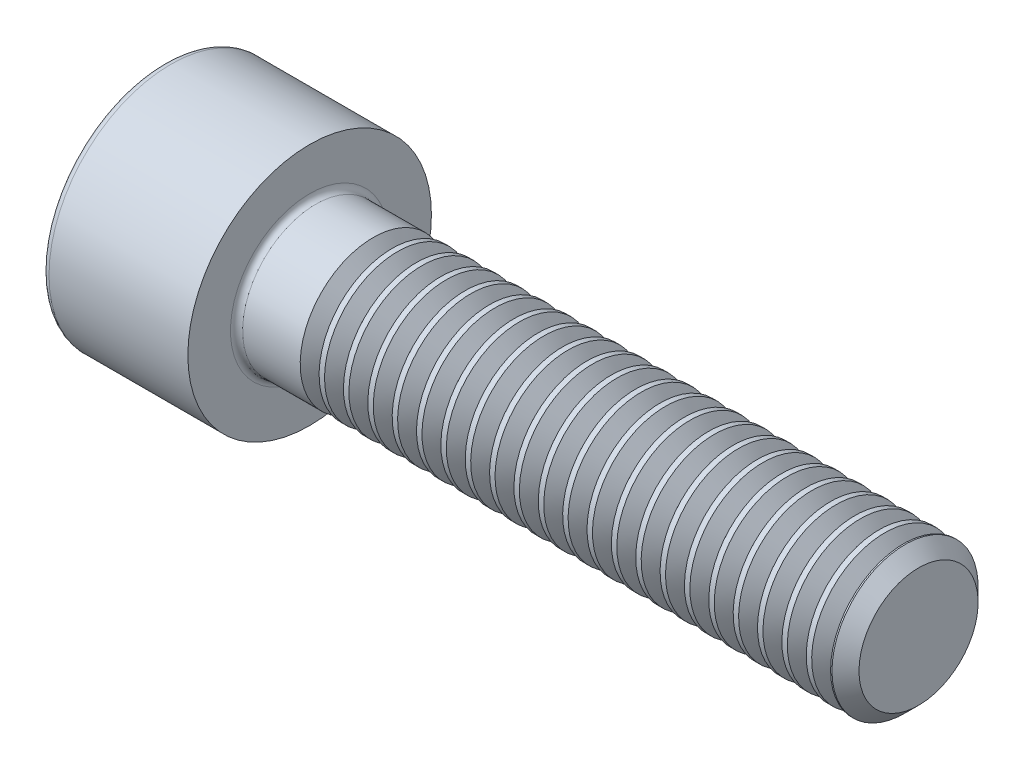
ISO-10303-21;
HEADER;
FILE_DESCRIPTION(('STEP AP214'),'2;1');
FILE_NAME('part.step','',(''),(''),'','','');
FILE_SCHEMA(('AUTOMOTIVE_DESIGN { 1 0 10303 214 1 1 1 1 }'));
ENDSEC;
DATA;
#1=APPLICATION_CONTEXT('core data for automotive mechanical design processes');
#2=APPLICATION_PROTOCOL_DEFINITION('international standard','automotive_design',2000,#1);
#3=PRODUCT_CONTEXT('',#1,'mechanical');
#4=PRODUCT('Part','Part','',(#3));
#5=PRODUCT_RELATED_PRODUCT_CATEGORY('part','',(#4));
#6=PRODUCT_DEFINITION_FORMATION('','',#4);
#7=PRODUCT_DEFINITION_CONTEXT('part definition',#1,'design');
#8=PRODUCT_DEFINITION('design','',#6,#7);
#9=PRODUCT_DEFINITION_SHAPE('','',#8);
#10=(LENGTH_UNIT() NAMED_UNIT(*) SI_UNIT(.MILLI.,.METRE.));
#11=(NAMED_UNIT(*) PLANE_ANGLE_UNIT() SI_UNIT($,.RADIAN.));
#12=(NAMED_UNIT(*) SI_UNIT($,.STERADIAN.) SOLID_ANGLE_UNIT());
#13=UNCERTAINTY_MEASURE_WITH_UNIT(LENGTH_MEASURE(1.E-05),#10,'distance_accuracy_value','');
#14=(GEOMETRIC_REPRESENTATION_CONTEXT(3) GLOBAL_UNCERTAINTY_ASSIGNED_CONTEXT((#13)) GLOBAL_UNIT_ASSIGNED_CONTEXT((#10,
#11,#12)) REPRESENTATION_CONTEXT('',''));
#15=CARTESIAN_POINT('',(0.,0.,0.));
#16=DIRECTION('',(0.,0.,1.));
#17=DIRECTION('',(1.,0.,0.));
#18=AXIS2_PLACEMENT_3D('',#15,#16,#17);
#19=CARTESIAN_POINT('',(0.,0.,0.));
#20=DIRECTION('',(-1.,0.,0.));
#21=DIRECTION('',(0.,0.,1.));
#22=AXIS2_PLACEMENT_3D('',#19,#20,#21);
#23=PLANE('',#22);
#24=DIRECTION('',(0.,-0.499999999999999,0.866025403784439));
#25=VECTOR('',#24,1.);
#26=CARTESIAN_POINT('',(0.,2.93524876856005,0.));
#27=LINE('',#26,#25);
#28=CARTESIAN_POINT('',(0.,2.93524876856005,0.));
#29=VERTEX_POINT('',#28);
#30=CARTESIAN_POINT('',(0.,1.46762438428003,2.542));
#31=VERTEX_POINT('',#30);
#32=EDGE_CURVE('E117',#29,#31,#27,.T.);
#33=ORIENTED_EDGE('',*,*,#32,.T.);
#34=DIRECTION('',(0.,1.,0.));
#35=VECTOR('',#34,1.);
#36=CARTESIAN_POINT('',(0.,-1.46762438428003,2.542));
#37=LINE('',#36,#35);
#38=CARTESIAN_POINT('',(0.,-1.46762438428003,2.542));
#39=VERTEX_POINT('',#38);
#40=EDGE_CURVE('E106',#39,#31,#37,.T.);
#41=ORIENTED_EDGE('',*,*,#40,.F.);
#42=DIRECTION('',(0.,-0.500000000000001,-0.866025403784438));
#43=VECTOR('',#42,1.);
#44=CARTESIAN_POINT('',(0.,-1.46762438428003,2.542));
#45=LINE('',#44,#43);
#46=CARTESIAN_POINT('',(0.,-2.93524876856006,0.));
#47=VERTEX_POINT('',#46);
#48=EDGE_CURVE('E116',#39,#47,#45,.T.);
#49=ORIENTED_EDGE('',*,*,#48,.T.);
#50=DIRECTION('',(0.,0.499999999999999,-0.866025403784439));
#51=VECTOR('',#50,1.);
#52=CARTESIAN_POINT('',(0.,-2.93524876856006,0.));
#53=LINE('',#52,#51);
#54=CARTESIAN_POINT('',(0.,-1.46762438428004,-2.542));
#55=VERTEX_POINT('',#54);
#56=EDGE_CURVE('E136',#47,#55,#53,.T.);
#57=ORIENTED_EDGE('',*,*,#56,.T.);
#58=DIRECTION('',(0.,-1.,0.));
#59=VECTOR('',#58,1.);
#60=CARTESIAN_POINT('',(0.,1.46762438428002,-2.542));
#61=LINE('',#60,#59);
#62=CARTESIAN_POINT('',(0.,1.46762438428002,-2.542));
#63=VERTEX_POINT('',#62);
#64=EDGE_CURVE('E139',#63,#55,#61,.T.);
#65=ORIENTED_EDGE('',*,*,#64,.F.);
#66=DIRECTION('',(0.,-0.500000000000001,-0.866025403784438));
#67=VECTOR('',#66,1.);
#68=CARTESIAN_POINT('',(0.,2.93524876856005,0.));
#69=LINE('',#68,#67);
#70=EDGE_CURVE('E126',#29,#63,#69,.T.);
#71=ORIENTED_EDGE('',*,*,#70,.F.);
#72=EDGE_LOOP('',(#33,#41,#49,#57,#65,#71));
#73=FACE_BOUND('',#72,.T.);
#74=CARTESIAN_POINT('',(0.,0.,0.));
#75=DIRECTION('',(-1.,0.,0.));
#76=DIRECTION('',(0.,0.,1.));
#77=AXIS2_PLACEMENT_3D('',#74,#75,#76);
#78=CIRCLE('',#77,4.7);
#79=CARTESIAN_POINT('',(0.,0.,4.7));
#80=VERTEX_POINT('',#79);
#81=EDGE_CURVE('E41',#80,#80,#78,.T.);
#82=ORIENTED_EDGE('',*,*,#81,.T.);
#83=EDGE_LOOP('',(#82));
#84=FACE_BOUND('',#83,.T.);
#85=ADVANCED_FACE('F33',(#73,#84),#23,.T.);
#86=CARTESIAN_POINT('',(-31.75,0.,0.));
#87=DIRECTION('',(-1.,0.,0.));
#88=DIRECTION('',(0.,0.,1.));
#89=AXIS2_PLACEMENT_3D('',#86,#87,#88);
#90=CYLINDRICAL_SURFACE('',#89,3.);
#91=CARTESIAN_POINT('',(8.6117349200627,0.,0.));
#92=DIRECTION('',(-1.,0.,0.));
#93=DIRECTION('',(0.,-1.,0.));
#94=AXIS2_PLACEMENT_3D('',#91,#92,#93);
#95=CIRCLE('',#94,3.);
#96=CARTESIAN_POINT('',(8.6117349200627,-3.,0.));
#97=VERTEX_POINT('',#96);
#98=EDGE_CURVE('E131',#97,#97,#95,.T.);
#99=ORIENTED_EDGE('',*,*,#98,.T.);
#100=EDGE_LOOP('',(#99));
#101=FACE_BOUND('',#100,.T.);
#102=CARTESIAN_POINT('',(6.25,0.,0.));
#103=DIRECTION('',(1.,0.,0.));
#104=DIRECTION('',(0.,0.,-1.));
#105=AXIS2_PLACEMENT_3D('',#102,#103,#104);
#106=CIRCLE('',#105,3.);
#107=CARTESIAN_POINT('',(6.25,0.,-3.));
#108=VERTEX_POINT('',#107);
#109=EDGE_CURVE('E191',#108,#108,#106,.T.);
#110=ORIENTED_EDGE('',*,*,#109,.T.);
#111=EDGE_LOOP('',(#110));
#112=FACE_BOUND('',#111,.T.);
#113=ADVANCED_FACE('F212',(#101,#112),#90,.T.);
#114=CARTESIAN_POINT('',(6.,5.,0.));
#115=DIRECTION('',(1.,0.,0.));
#116=DIRECTION('',(0.,0.,-1.));
#117=AXIS2_PLACEMENT_3D('',#114,#115,#116);
#118=PLANE('',#117);
#119=CARTESIAN_POINT('',(6.,0.,0.));
#120=DIRECTION('',(1.,0.,0.));
#121=DIRECTION('',(0.,0.,-1.));
#122=AXIS2_PLACEMENT_3D('',#119,#120,#121);
#123=CIRCLE('',#122,3.25);
#124=CARTESIAN_POINT('',(6.,0.,-3.25));
#125=VERTEX_POINT('',#124);
#126=EDGE_CURVE('E188',#125,#125,#123,.F.);
#127=ORIENTED_EDGE('',*,*,#126,.T.);
#128=EDGE_LOOP('',(#127));
#129=FACE_BOUND('',#128,.T.);
#130=CARTESIAN_POINT('',(6.,0.,0.));
#131=DIRECTION('',(-1.,0.,0.));
#132=DIRECTION('',(0.,0.,1.));
#133=AXIS2_PLACEMENT_3D('',#130,#131,#132);
#134=CIRCLE('',#133,5.);
#135=CARTESIAN_POINT('',(6.,0.,5.));
#136=VERTEX_POINT('',#135);
#137=EDGE_CURVE('E178',#136,#136,#134,.T.);
#138=ORIENTED_EDGE('',*,*,#137,.F.);
#139=EDGE_LOOP('',(#138));
#140=FACE_BOUND('',#139,.T.);
#141=ADVANCED_FACE('F217',(#129,#140),#118,.T.);
#142=CARTESIAN_POINT('',(-31.75,0.,0.));
#143=DIRECTION('',(-1.,0.,0.));
#144=DIRECTION('',(0.,0.,1.));
#145=AXIS2_PLACEMENT_3D('',#142,#143,#144);
#146=CYLINDRICAL_SURFACE('',#145,5.);
#147=CARTESIAN_POINT('',(0.300000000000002,0.,0.));
#148=DIRECTION('',(-1.,0.,0.));
#149=DIRECTION('',(0.,0.,1.));
#150=AXIS2_PLACEMENT_3D('',#147,#148,#149);
#151=CIRCLE('',#150,5.);
#152=CARTESIAN_POINT('',(0.300000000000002,0.,5.));
#153=VERTEX_POINT('',#152);
#154=EDGE_CURVE('E11',#153,#153,#151,.F.);
#155=ORIENTED_EDGE('',*,*,#154,.T.);
#156=EDGE_LOOP('',(#155));
#157=FACE_BOUND('',#156,.T.);
#158=ORIENTED_EDGE('',*,*,#137,.T.);
#159=EDGE_LOOP('',(#158));
#160=FACE_BOUND('',#159,.T.);
#161=ADVANCED_FACE('F206',(#157,#160),#146,.T.);
#162=CARTESIAN_POINT('',(6.25,0.,0.));
#163=DIRECTION('',(1.,0.,0.));
#164=DIRECTION('',(0.,0.,-1.));
#165=AXIS2_PLACEMENT_3D('',#162,#163,#164);
#166=TOROIDAL_SURFACE('',#165,3.25,0.25);
#167=ORIENTED_EDGE('',*,*,#109,.F.);
#168=EDGE_LOOP('',(#167));
#169=FACE_BOUND('',#168,.T.);
#170=ORIENTED_EDGE('',*,*,#126,.F.);
#171=EDGE_LOOP('',(#170));
#172=FACE_BOUND('',#171,.T.);
#173=ADVANCED_FACE('F198',(#169,#172),#166,.F.);
#174=CARTESIAN_POINT('',(0.300000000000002,0.,0.));
#175=DIRECTION('',(-1.,0.,0.));
#176=DIRECTION('',(0.,0.,1.));
#177=AXIS2_PLACEMENT_3D('',#174,#175,#176);
#178=TOROIDAL_SURFACE('',#177,4.7,0.3);
#179=ORIENTED_EDGE('',*,*,#154,.F.);
#180=EDGE_LOOP('',(#179));
#181=FACE_BOUND('',#180,.T.);
#182=ORIENTED_EDGE('',*,*,#81,.F.);
#183=EDGE_LOOP('',(#182));
#184=FACE_BOUND('',#183,.T.);
#185=ADVANCED_FACE('F196',(#181,#184),#178,.T.);
#186=CARTESIAN_POINT('',(3.,2.93524876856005,0.));
#187=DIRECTION('',(0.,-0.866025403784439,-0.499999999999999));
#188=DIRECTION('',(0.,0.499999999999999,-0.866025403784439));
#189=AXIS2_PLACEMENT_3D('',#186,#187,#188);
#190=PLANE('',#189);
#191=ORIENTED_EDGE('',*,*,#32,.F.);
#192=DIRECTION('',(-1.,0.,0.));
#193=VECTOR('',#192,1.);
#194=CARTESIAN_POINT('',(3.,2.93524876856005,0.));
#195=LINE('',#194,#193);
#196=CARTESIAN_POINT('',(3.,2.93524876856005,0.));
#197=VERTEX_POINT('',#196);
#198=EDGE_CURVE('E163',#197,#29,#195,.T.);
#199=ORIENTED_EDGE('',*,*,#198,.F.);
#200=DIRECTION('',(0.,-0.499999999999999,0.866025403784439));
#201=VECTOR('',#200,1.);
#202=CARTESIAN_POINT('',(3.,2.93524876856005,0.));
#203=LINE('',#202,#201);
#204=CARTESIAN_POINT('',(3.,2.20143657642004,1.271));
#205=VERTEX_POINT('',#204);
#206=EDGE_CURVE('E48',#197,#205,#203,.T.);
#207=ORIENTED_EDGE('',*,*,#206,.T.);
#208=CARTESIAN_POINT('',(3.,1.46762438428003,2.542));
#209=VERTEX_POINT('',#208);
#210=EDGE_CURVE('E121',#205,#209,#203,.T.);
#211=ORIENTED_EDGE('',*,*,#210,.T.);
#212=DIRECTION('',(-1.,0.,0.));
#213=VECTOR('',#212,1.);
#214=CARTESIAN_POINT('',(3.,1.46762438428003,2.542));
#215=LINE('',#214,#213);
#216=EDGE_CURVE('E110',#209,#31,#215,.T.);
#217=ORIENTED_EDGE('',*,*,#216,.T.);
#218=EDGE_LOOP('',(#191,#199,#207,#211,#217));
#219=FACE_BOUND('',#218,.T.);
#220=ADVANCED_FACE('F119',(#219),#190,.T.);
#221=CARTESIAN_POINT('',(3.,-1.46762438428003,2.542));
#222=DIRECTION('',(0.,0.,1.));
#223=DIRECTION('',(0.,-1.,0.));
#224=AXIS2_PLACEMENT_3D('',#221,#222,#223);
#225=PLANE('',#224);
#226=ORIENTED_EDGE('',*,*,#40,.T.);
#227=ORIENTED_EDGE('',*,*,#216,.F.);
#228=DIRECTION('',(0.,1.,0.));
#229=VECTOR('',#228,1.);
#230=CARTESIAN_POINT('',(3.,-1.46762438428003,2.542));
#231=LINE('',#230,#229);
#232=CARTESIAN_POINT('',(3.,0.,2.542));
#233=VERTEX_POINT('',#232);
#234=EDGE_CURVE('E143',#233,#209,#231,.T.);
#235=ORIENTED_EDGE('',*,*,#234,.F.);
#236=CARTESIAN_POINT('',(3.,-1.46762438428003,2.542));
#237=VERTEX_POINT('',#236);
#238=EDGE_CURVE('E144',#237,#233,#231,.T.);
#239=ORIENTED_EDGE('',*,*,#238,.F.);
#240=DIRECTION('',(-1.,0.,0.));
#241=VECTOR('',#240,1.);
#242=CARTESIAN_POINT('',(3.,-1.46762438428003,2.542));
#243=LINE('',#242,#241);
#244=EDGE_CURVE('E112',#237,#39,#243,.T.);
#245=ORIENTED_EDGE('',*,*,#244,.T.);
#246=EDGE_LOOP('',(#226,#227,#235,#239,#245));
#247=FACE_BOUND('',#246,.T.);
#248=ADVANCED_FACE('F108',(#247),#225,.F.);
#249=CARTESIAN_POINT('',(3.,-1.46762438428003,2.542));
#250=DIRECTION('',(0.,0.866025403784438,-0.500000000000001));
#251=DIRECTION('',(0.,0.500000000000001,0.866025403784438));
#252=AXIS2_PLACEMENT_3D('',#249,#250,#251);
#253=PLANE('',#252);
#254=ORIENTED_EDGE('',*,*,#48,.F.);
#255=ORIENTED_EDGE('',*,*,#244,.F.);
#256=DIRECTION('',(0.,-0.500000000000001,-0.866025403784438));
#257=VECTOR('',#256,1.);
#258=CARTESIAN_POINT('',(3.,-1.46762438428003,2.542));
#259=LINE('',#258,#257);
#260=CARTESIAN_POINT('',(3.,-2.20143657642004,1.271));
#261=VERTEX_POINT('',#260);
#262=EDGE_CURVE('E148',#237,#261,#259,.T.);
#263=ORIENTED_EDGE('',*,*,#262,.T.);
#264=CARTESIAN_POINT('',(3.,-2.93524876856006,0.));
#265=VERTEX_POINT('',#264);
#266=EDGE_CURVE('E147',#261,#265,#259,.T.);
#267=ORIENTED_EDGE('',*,*,#266,.T.);
#268=DIRECTION('',(-1.,0.,0.));
#269=VECTOR('',#268,1.);
#270=CARTESIAN_POINT('',(3.,-2.93524876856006,0.));
#271=LINE('',#270,#269);
#272=EDGE_CURVE('E171',#265,#47,#271,.T.);
#273=ORIENTED_EDGE('',*,*,#272,.T.);
#274=EDGE_LOOP('',(#254,#255,#263,#267,#273));
#275=FACE_BOUND('',#274,.T.);
#276=ADVANCED_FACE('F462',(#275),#253,.T.);
#277=CARTESIAN_POINT('',(3.,-2.93524876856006,0.));
#278=DIRECTION('',(0.,0.866025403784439,0.499999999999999));
#279=DIRECTION('',(0.,-0.499999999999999,0.866025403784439));
#280=AXIS2_PLACEMENT_3D('',#277,#278,#279);
#281=PLANE('',#280);
#282=ORIENTED_EDGE('',*,*,#56,.F.);
#283=ORIENTED_EDGE('',*,*,#272,.F.);
#284=DIRECTION('',(0.,0.499999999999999,-0.866025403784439));
#285=VECTOR('',#284,1.);
#286=CARTESIAN_POINT('',(3.,-2.93524876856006,0.));
#287=LINE('',#286,#285);
#288=CARTESIAN_POINT('',(3.,-2.20143657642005,-1.271));
#289=VERTEX_POINT('',#288);
#290=EDGE_CURVE('E152',#265,#289,#287,.T.);
#291=ORIENTED_EDGE('',*,*,#290,.T.);
#292=CARTESIAN_POINT('',(3.,-1.46762438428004,-2.542));
#293=VERTEX_POINT('',#292);
#294=EDGE_CURVE('E151',#289,#293,#287,.T.);
#295=ORIENTED_EDGE('',*,*,#294,.T.);
#296=DIRECTION('',(-1.,0.,0.));
#297=VECTOR('',#296,1.);
#298=CARTESIAN_POINT('',(3.,-1.46762438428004,-2.542));
#299=LINE('',#298,#297);
#300=EDGE_CURVE('E168',#293,#55,#299,.T.);
#301=ORIENTED_EDGE('',*,*,#300,.T.);
#302=EDGE_LOOP('',(#282,#283,#291,#295,#301));
#303=FACE_BOUND('',#302,.T.);
#304=ADVANCED_FACE('F458',(#303),#281,.T.);
#305=CARTESIAN_POINT('',(3.,1.46762438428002,-2.542));
#306=DIRECTION('',(0.,0.,-1.));
#307=DIRECTION('',(0.,1.,0.));
#308=AXIS2_PLACEMENT_3D('',#305,#306,#307);
#309=PLANE('',#308);
#310=ORIENTED_EDGE('',*,*,#64,.T.);
#311=ORIENTED_EDGE('',*,*,#300,.F.);
#312=DIRECTION('',(0.,-1.,0.));
#313=VECTOR('',#312,1.);
#314=CARTESIAN_POINT('',(3.,1.46762438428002,-2.542));
#315=LINE('',#314,#313);
#316=CARTESIAN_POINT('',(3.,0.,-2.542));
#317=VERTEX_POINT('',#316);
#318=EDGE_CURVE('E155',#317,#293,#315,.T.);
#319=ORIENTED_EDGE('',*,*,#318,.F.);
#320=CARTESIAN_POINT('',(3.,1.46762438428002,-2.542));
#321=VERTEX_POINT('',#320);
#322=EDGE_CURVE('E156',#321,#317,#315,.T.);
#323=ORIENTED_EDGE('',*,*,#322,.F.);
#324=DIRECTION('',(-1.,0.,0.));
#325=VECTOR('',#324,1.);
#326=CARTESIAN_POINT('',(3.,1.46762438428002,-2.542));
#327=LINE('',#326,#325);
#328=EDGE_CURVE('E165',#321,#63,#327,.T.);
#329=ORIENTED_EDGE('',*,*,#328,.T.);
#330=EDGE_LOOP('',(#310,#311,#319,#323,#329));
#331=FACE_BOUND('',#330,.T.);
#332=ADVANCED_FACE('F454',(#331),#309,.F.);
#333=CARTESIAN_POINT('',(3.,2.93524876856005,0.));
#334=DIRECTION('',(0.,0.866025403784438,-0.500000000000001));
#335=DIRECTION('',(0.,0.500000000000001,0.866025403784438));
#336=AXIS2_PLACEMENT_3D('',#333,#334,#335);
#337=PLANE('',#336);
#338=ORIENTED_EDGE('',*,*,#70,.T.);
#339=ORIENTED_EDGE('',*,*,#328,.F.);
#340=DIRECTION('',(0.,-0.500000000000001,-0.866025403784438));
#341=VECTOR('',#340,1.);
#342=CARTESIAN_POINT('',(3.,2.93524876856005,0.));
#343=LINE('',#342,#341);
#344=CARTESIAN_POINT('',(3.,2.20143657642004,-1.271));
#345=VERTEX_POINT('',#344);
#346=EDGE_CURVE('E159',#345,#321,#343,.T.);
#347=ORIENTED_EDGE('',*,*,#346,.F.);
#348=EDGE_CURVE('E160',#197,#345,#343,.T.);
#349=ORIENTED_EDGE('',*,*,#348,.F.);
#350=ORIENTED_EDGE('',*,*,#198,.T.);
#351=EDGE_LOOP('',(#338,#339,#347,#349,#350));
#352=FACE_BOUND('',#351,.T.);
#353=ADVANCED_FACE('F449',(#352),#337,.F.);
#354=CARTESIAN_POINT('',(3.,1.46762438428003,2.542));
#355=DIRECTION('',(-1.,0.,0.));
#356=DIRECTION('',(0.,0.,1.));
#357=AXIS2_PLACEMENT_3D('',#354,#355,#356);
#358=PLANE('',#357);
#359=CARTESIAN_POINT('',(3.,0.,0.));
#360=DIRECTION('',(-1.,0.,0.));
#361=DIRECTION('',(0.,0.,1.));
#362=AXIS2_PLACEMENT_3D('',#359,#360,#361);
#363=CIRCLE('',#362,2.542);
#364=EDGE_CURVE('E122',#261,#233,#363,.T.);
#365=ORIENTED_EDGE('',*,*,#364,.F.);
#366=ORIENTED_EDGE('',*,*,#262,.F.);
#367=ORIENTED_EDGE('',*,*,#238,.T.);
#368=EDGE_LOOP('',(#365,#366,#367));
#369=FACE_BOUND('',#368,.T.);
#370=ADVANCED_FACE('F445',(#369),#358,.T.);
#371=EDGE_CURVE('E484',#289,#261,#363,.T.);
#372=ORIENTED_EDGE('',*,*,#371,.F.);
#373=ORIENTED_EDGE('',*,*,#290,.F.);
#374=ORIENTED_EDGE('',*,*,#266,.F.);
#375=EDGE_LOOP('',(#372,#373,#374));
#376=FACE_BOUND('',#375,.T.);
#377=ADVANCED_FACE('F448',(#376),#358,.T.);
#378=EDGE_CURVE('E485',#317,#289,#363,.T.);
#379=ORIENTED_EDGE('',*,*,#378,.F.);
#380=ORIENTED_EDGE('',*,*,#318,.T.);
#381=ORIENTED_EDGE('',*,*,#294,.F.);
#382=EDGE_LOOP('',(#379,#380,#381));
#383=FACE_BOUND('',#382,.T.);
#384=ADVANCED_FACE('F501',(#383),#358,.T.);
#385=EDGE_CURVE('E489',#345,#317,#363,.T.);
#386=ORIENTED_EDGE('',*,*,#385,.F.);
#387=ORIENTED_EDGE('',*,*,#346,.T.);
#388=ORIENTED_EDGE('',*,*,#322,.T.);
#389=EDGE_LOOP('',(#386,#387,#388));
#390=FACE_BOUND('',#389,.T.);
#391=ADVANCED_FACE('F492',(#390),#358,.T.);
#392=EDGE_CURVE('E179',#205,#345,#363,.T.);
#393=ORIENTED_EDGE('',*,*,#392,.F.);
#394=ORIENTED_EDGE('',*,*,#206,.F.);
#395=ORIENTED_EDGE('',*,*,#348,.T.);
#396=EDGE_LOOP('',(#393,#394,#395));
#397=FACE_BOUND('',#396,.T.);
#398=ADVANCED_FACE('F472',(#397),#358,.T.);
#399=EDGE_CURVE('E175',#233,#205,#363,.T.);
#400=ORIENTED_EDGE('',*,*,#399,.F.);
#401=ORIENTED_EDGE('',*,*,#234,.T.);
#402=ORIENTED_EDGE('',*,*,#210,.F.);
#403=EDGE_LOOP('',(#400,#401,#402));
#404=FACE_BOUND('',#403,.T.);
#405=ADVANCED_FACE('F451',(#404),#358,.T.);
#406=CARTESIAN_POINT('',(3.,0.,0.));
#407=DIRECTION('',(-1.,0.,0.));
#408=DIRECTION('',(0.,0.,1.));
#409=AXIS2_PLACEMENT_3D('',#406,#407,#408);
#410=CONICAL_SURFACE('',#409,2.542,1.04719755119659);
#411=CARTESIAN_POINT('',(4.46762438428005,0.,0.));
#412=VERTEX_POINT('',#411);
#413=VERTEX_LOOP('',#412);
#414=FACE_BOUND('',#413,.T.);
#415=ORIENTED_EDGE('',*,*,#399,.T.);
#416=ORIENTED_EDGE('',*,*,#392,.T.);
#417=ORIENTED_EDGE('',*,*,#385,.T.);
#418=ORIENTED_EDGE('',*,*,#378,.T.);
#419=ORIENTED_EDGE('',*,*,#371,.T.);
#420=ORIENTED_EDGE('',*,*,#364,.T.);
#421=EDGE_LOOP('',(#415,#416,#417,#418,#419,#420));
#422=FACE_BOUND('',#421,.T.);
#423=ADVANCED_FACE('F443',(#414,#422),#410,.F.);
#424=CARTESIAN_POINT('',(9.38826507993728,0.,0.));
#425=DIRECTION('',(1.,0.,0.));
#426=DIRECTION('',(0.,1.,0.));
#427=AXIS2_PLACEMENT_3D('',#424,#425,#426);
#428=CONICAL_SURFACE('',#427,3.,0.959931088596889);
#429=CARTESIAN_POINT('',(9.,0.,0.));
#430=DIRECTION('',(-1.,0.,0.));
#431=DIRECTION('',(0.,-1.,0.));
#432=AXIS2_PLACEMENT_3D('',#429,#430,#431);
#433=CIRCLE('',#432,2.4455);
#434=CARTESIAN_POINT('',(9.,-2.4455,0.));
#435=VERTEX_POINT('',#434);
#436=EDGE_CURVE('E1211',#435,#435,#433,.T.);
#437=ORIENTED_EDGE('',*,*,#436,.F.);
#438=EDGE_LOOP('',(#437));
#439=FACE_BOUND('',#438,.T.);
#440=CARTESIAN_POINT('',(9.38826507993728,0.,0.));
#441=DIRECTION('',(-1.,0.,0.));
#442=DIRECTION('',(0.,-1.,0.));
#443=AXIS2_PLACEMENT_3D('',#440,#441,#442);
#444=CIRCLE('',#443,3.);
#445=CARTESIAN_POINT('',(9.38826507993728,-3.,0.));
#446=VERTEX_POINT('',#445);
#447=EDGE_CURVE('E128',#446,#446,#444,.T.);
#448=ORIENTED_EDGE('',*,*,#447,.T.);
#449=EDGE_LOOP('',(#448));
#450=FACE_BOUND('',#449,.T.);
#451=ADVANCED_FACE('F439',(#439,#450),#428,.T.);
#452=CARTESIAN_POINT('',(9.,0.,0.));
#453=DIRECTION('',(-1.,0.,0.));
#454=DIRECTION('',(0.,-1.,0.));
#455=AXIS2_PLACEMENT_3D('',#452,#453,#454);
#456=CONICAL_SURFACE('',#455,2.4455,0.959931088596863);
#457=ORIENTED_EDGE('',*,*,#98,.F.);
#458=EDGE_LOOP('',(#457));
#459=FACE_BOUND('',#458,.T.);
#460=ORIENTED_EDGE('',*,*,#436,.T.);
#461=EDGE_LOOP('',(#460));
#462=FACE_BOUND('',#461,.T.);
#463=ADVANCED_FACE('F436',(#459,#462),#456,.T.);
#464=CARTESIAN_POINT('',(9.6117349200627,0.,0.));
#465=DIRECTION('',(-1.,0.,0.));
#466=DIRECTION('',(0.,-1.,0.));
#467=AXIS2_PLACEMENT_3D('',#464,#465,#466);
#468=CIRCLE('',#467,3.);
#469=CARTESIAN_POINT('',(9.6117349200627,-3.,0.));
#470=VERTEX_POINT('',#469);
#471=EDGE_CURVE('E1205',#470,#470,#468,.T.);
#472=ORIENTED_EDGE('',*,*,#471,.T.);
#473=EDGE_LOOP('',(#472));
#474=FACE_BOUND('',#473,.T.);
#475=ORIENTED_EDGE('',*,*,#447,.F.);
#476=EDGE_LOOP('',(#475));
#477=FACE_BOUND('',#476,.T.);
#478=ADVANCED_FACE('F221',(#474,#477),#90,.T.);
#479=CARTESIAN_POINT('',(10.3882650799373,0.,0.));
#480=DIRECTION('',(1.,0.,0.));
#481=DIRECTION('',(0.,1.,0.));
#482=AXIS2_PLACEMENT_3D('',#479,#480,#481);
#483=CONICAL_SURFACE('',#482,3.,0.959931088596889);
#484=CARTESIAN_POINT('',(10.,0.,0.));
#485=DIRECTION('',(-1.,0.,0.));
#486=DIRECTION('',(0.,-1.,0.));
#487=AXIS2_PLACEMENT_3D('',#484,#485,#486);
#488=CIRCLE('',#487,2.4455);
#489=CARTESIAN_POINT('',(10.,-2.4455,0.));
#490=VERTEX_POINT('',#489);
#491=EDGE_CURVE('E1202',#490,#490,#488,.T.);
#492=ORIENTED_EDGE('',*,*,#491,.F.);
#493=EDGE_LOOP('',(#492));
#494=FACE_BOUND('',#493,.T.);
#495=CARTESIAN_POINT('',(10.3882650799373,0.,0.));
#496=DIRECTION('',(-1.,0.,0.));
#497=DIRECTION('',(0.,-1.,0.));
#498=AXIS2_PLACEMENT_3D('',#495,#496,#497);
#499=CIRCLE('',#498,3.);
#500=CARTESIAN_POINT('',(10.3882650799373,-3.,0.));
#501=VERTEX_POINT('',#500);
#502=EDGE_CURVE('E1208',#501,#501,#499,.T.);
#503=ORIENTED_EDGE('',*,*,#502,.T.);
#504=EDGE_LOOP('',(#503));
#505=FACE_BOUND('',#504,.T.);
#506=ADVANCED_FACE('F431',(#494,#505),#483,.T.);
#507=CARTESIAN_POINT('',(10.,0.,0.));
#508=DIRECTION('',(-1.,0.,0.));
#509=DIRECTION('',(0.,-1.,0.));
#510=AXIS2_PLACEMENT_3D('',#507,#508,#509);
#511=CONICAL_SURFACE('',#510,2.4455,0.959931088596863);
#512=ORIENTED_EDGE('',*,*,#471,.F.);
#513=EDGE_LOOP('',(#512));
#514=FACE_BOUND('',#513,.T.);
#515=ORIENTED_EDGE('',*,*,#491,.T.);
#516=EDGE_LOOP('',(#515));
#517=FACE_BOUND('',#516,.T.);
#518=ADVANCED_FACE('F428',(#514,#517),#511,.T.);
#519=CARTESIAN_POINT('',(10.6117349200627,0.,0.));
#520=DIRECTION('',(-1.,0.,0.));
#521=DIRECTION('',(0.,-1.,0.));
#522=AXIS2_PLACEMENT_3D('',#519,#520,#521);
#523=CIRCLE('',#522,3.);
#524=CARTESIAN_POINT('',(10.6117349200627,-3.,0.));
#525=VERTEX_POINT('',#524);
#526=EDGE_CURVE('E1196',#525,#525,#523,.T.);
#527=ORIENTED_EDGE('',*,*,#526,.T.);
#528=EDGE_LOOP('',(#527));
#529=FACE_BOUND('',#528,.T.);
#530=ORIENTED_EDGE('',*,*,#502,.F.);
#531=EDGE_LOOP('',(#530));
#532=FACE_BOUND('',#531,.T.);
#533=ADVANCED_FACE('F426',(#529,#532),#90,.T.);
#534=CARTESIAN_POINT('',(11.3882650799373,0.,0.));
#535=DIRECTION('',(1.,0.,0.));
#536=DIRECTION('',(0.,1.,0.));
#537=AXIS2_PLACEMENT_3D('',#534,#535,#536);
#538=CONICAL_SURFACE('',#537,3.,0.959931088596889);
#539=CARTESIAN_POINT('',(11.,0.,0.));
#540=DIRECTION('',(-1.,0.,0.));
#541=DIRECTION('',(0.,-1.,0.));
#542=AXIS2_PLACEMENT_3D('',#539,#540,#541);
#543=CIRCLE('',#542,2.4455);
#544=CARTESIAN_POINT('',(11.,-2.4455,0.));
#545=VERTEX_POINT('',#544);
#546=EDGE_CURVE('E1193',#545,#545,#543,.T.);
#547=ORIENTED_EDGE('',*,*,#546,.F.);
#548=EDGE_LOOP('',(#547));
#549=FACE_BOUND('',#548,.T.);
#550=CARTESIAN_POINT('',(11.3882650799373,0.,0.));
#551=DIRECTION('',(-1.,0.,0.));
#552=DIRECTION('',(0.,-1.,0.));
#553=AXIS2_PLACEMENT_3D('',#550,#551,#552);
#554=CIRCLE('',#553,3.);
#555=CARTESIAN_POINT('',(11.3882650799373,-3.,0.));
#556=VERTEX_POINT('',#555);
#557=EDGE_CURVE('E1199',#556,#556,#554,.T.);
#558=ORIENTED_EDGE('',*,*,#557,.T.);
#559=EDGE_LOOP('',(#558));
#560=FACE_BOUND('',#559,.T.);
#561=ADVANCED_FACE('F422',(#549,#560),#538,.T.);
#562=CARTESIAN_POINT('',(11.,0.,0.));
#563=DIRECTION('',(-1.,0.,0.));
#564=DIRECTION('',(0.,-1.,0.));
#565=AXIS2_PLACEMENT_3D('',#562,#563,#564);
#566=CONICAL_SURFACE('',#565,2.4455,0.959931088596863);
#567=ORIENTED_EDGE('',*,*,#526,.F.);
#568=EDGE_LOOP('',(#567));
#569=FACE_BOUND('',#568,.T.);
#570=ORIENTED_EDGE('',*,*,#546,.T.);
#571=EDGE_LOOP('',(#570));
#572=FACE_BOUND('',#571,.T.);
#573=ADVANCED_FACE('F419',(#569,#572),#566,.T.);
#574=CARTESIAN_POINT('',(11.6117349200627,0.,0.));
#575=DIRECTION('',(-1.,0.,0.));
#576=DIRECTION('',(0.,-1.,0.));
#577=AXIS2_PLACEMENT_3D('',#574,#575,#576);
#578=CIRCLE('',#577,3.);
#579=CARTESIAN_POINT('',(11.6117349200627,-3.,0.));
#580=VERTEX_POINT('',#579);
#581=EDGE_CURVE('E1187',#580,#580,#578,.T.);
#582=ORIENTED_EDGE('',*,*,#581,.T.);
#583=EDGE_LOOP('',(#582));
#584=FACE_BOUND('',#583,.T.);
#585=ORIENTED_EDGE('',*,*,#557,.F.);
#586=EDGE_LOOP('',(#585));
#587=FACE_BOUND('',#586,.T.);
#588=ADVANCED_FACE('F417',(#584,#587),#90,.T.);
#589=CARTESIAN_POINT('',(12.3882650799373,0.,0.));
#590=DIRECTION('',(1.,0.,0.));
#591=DIRECTION('',(0.,1.,0.));
#592=AXIS2_PLACEMENT_3D('',#589,#590,#591);
#593=CONICAL_SURFACE('',#592,3.,0.959931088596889);
#594=CARTESIAN_POINT('',(12.,0.,0.));
#595=DIRECTION('',(-1.,0.,0.));
#596=DIRECTION('',(0.,-1.,0.));
#597=AXIS2_PLACEMENT_3D('',#594,#595,#596);
#598=CIRCLE('',#597,2.4455);
#599=CARTESIAN_POINT('',(12.,-2.4455,0.));
#600=VERTEX_POINT('',#599);
#601=EDGE_CURVE('E1184',#600,#600,#598,.T.);
#602=ORIENTED_EDGE('',*,*,#601,.F.);
#603=EDGE_LOOP('',(#602));
#604=FACE_BOUND('',#603,.T.);
#605=CARTESIAN_POINT('',(12.3882650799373,0.,0.));
#606=DIRECTION('',(-1.,0.,0.));
#607=DIRECTION('',(0.,-1.,0.));
#608=AXIS2_PLACEMENT_3D('',#605,#606,#607);
#609=CIRCLE('',#608,3.);
#610=CARTESIAN_POINT('',(12.3882650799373,-3.,0.));
#611=VERTEX_POINT('',#610);
#612=EDGE_CURVE('E1190',#611,#611,#609,.T.);
#613=ORIENTED_EDGE('',*,*,#612,.T.);
#614=EDGE_LOOP('',(#613));
#615=FACE_BOUND('',#614,.T.);
#616=ADVANCED_FACE('F413',(#604,#615),#593,.T.);
#617=CARTESIAN_POINT('',(12.,0.,0.));
#618=DIRECTION('',(-1.,0.,0.));
#619=DIRECTION('',(0.,-1.,0.));
#620=AXIS2_PLACEMENT_3D('',#617,#618,#619);
#621=CONICAL_SURFACE('',#620,2.4455,0.959931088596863);
#622=ORIENTED_EDGE('',*,*,#581,.F.);
#623=EDGE_LOOP('',(#622));
#624=FACE_BOUND('',#623,.T.);
#625=ORIENTED_EDGE('',*,*,#601,.T.);
#626=EDGE_LOOP('',(#625));
#627=FACE_BOUND('',#626,.T.);
#628=ADVANCED_FACE('F410',(#624,#627),#621,.T.);
#629=CARTESIAN_POINT('',(12.6117349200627,0.,0.));
#630=DIRECTION('',(-1.,0.,0.));
#631=DIRECTION('',(0.,-1.,0.));
#632=AXIS2_PLACEMENT_3D('',#629,#630,#631);
#633=CIRCLE('',#632,3.);
#634=CARTESIAN_POINT('',(12.6117349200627,-3.,0.));
#635=VERTEX_POINT('',#634);
#636=EDGE_CURVE('E1178',#635,#635,#633,.T.);
#637=ORIENTED_EDGE('',*,*,#636,.T.);
#638=EDGE_LOOP('',(#637));
#639=FACE_BOUND('',#638,.T.);
#640=ORIENTED_EDGE('',*,*,#612,.F.);
#641=EDGE_LOOP('',(#640));
#642=FACE_BOUND('',#641,.T.);
#643=ADVANCED_FACE('F408',(#639,#642),#90,.T.);
#644=CARTESIAN_POINT('',(13.3882650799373,0.,0.));
#645=DIRECTION('',(1.,0.,0.));
#646=DIRECTION('',(0.,1.,0.));
#647=AXIS2_PLACEMENT_3D('',#644,#645,#646);
#648=CONICAL_SURFACE('',#647,3.,0.959931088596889);
#649=CARTESIAN_POINT('',(13.,0.,0.));
#650=DIRECTION('',(-1.,0.,0.));
#651=DIRECTION('',(0.,-1.,0.));
#652=AXIS2_PLACEMENT_3D('',#649,#650,#651);
#653=CIRCLE('',#652,2.4455);
#654=CARTESIAN_POINT('',(13.,-2.4455,0.));
#655=VERTEX_POINT('',#654);
#656=EDGE_CURVE('E1175',#655,#655,#653,.T.);
#657=ORIENTED_EDGE('',*,*,#656,.F.);
#658=EDGE_LOOP('',(#657));
#659=FACE_BOUND('',#658,.T.);
#660=CARTESIAN_POINT('',(13.3882650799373,0.,0.));
#661=DIRECTION('',(-1.,0.,0.));
#662=DIRECTION('',(0.,-1.,0.));
#663=AXIS2_PLACEMENT_3D('',#660,#661,#662);
#664=CIRCLE('',#663,3.);
#665=CARTESIAN_POINT('',(13.3882650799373,-3.,0.));
#666=VERTEX_POINT('',#665);
#667=EDGE_CURVE('E1181',#666,#666,#664,.T.);
#668=ORIENTED_EDGE('',*,*,#667,.T.);
#669=EDGE_LOOP('',(#668));
#670=FACE_BOUND('',#669,.T.);
#671=ADVANCED_FACE('F404',(#659,#670),#648,.T.);
#672=CARTESIAN_POINT('',(13.,0.,0.));
#673=DIRECTION('',(-1.,0.,0.));
#674=DIRECTION('',(0.,-1.,0.));
#675=AXIS2_PLACEMENT_3D('',#672,#673,#674);
#676=CONICAL_SURFACE('',#675,2.4455,0.959931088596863);
#677=ORIENTED_EDGE('',*,*,#636,.F.);
#678=EDGE_LOOP('',(#677));
#679=FACE_BOUND('',#678,.T.);
#680=ORIENTED_EDGE('',*,*,#656,.T.);
#681=EDGE_LOOP('',(#680));
#682=FACE_BOUND('',#681,.T.);
#683=ADVANCED_FACE('F401',(#679,#682),#676,.T.);
#684=CARTESIAN_POINT('',(13.6117349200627,0.,0.));
#685=DIRECTION('',(-1.,0.,0.));
#686=DIRECTION('',(0.,-1.,0.));
#687=AXIS2_PLACEMENT_3D('',#684,#685,#686);
#688=CIRCLE('',#687,3.);
#689=CARTESIAN_POINT('',(13.6117349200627,-3.,0.));
#690=VERTEX_POINT('',#689);
#691=EDGE_CURVE('E1169',#690,#690,#688,.T.);
#692=ORIENTED_EDGE('',*,*,#691,.T.);
#693=EDGE_LOOP('',(#692));
#694=FACE_BOUND('',#693,.T.);
#695=ORIENTED_EDGE('',*,*,#667,.F.);
#696=EDGE_LOOP('',(#695));
#697=FACE_BOUND('',#696,.T.);
#698=ADVANCED_FACE('F399',(#694,#697),#90,.T.);
#699=CARTESIAN_POINT('',(14.3882650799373,0.,0.));
#700=DIRECTION('',(1.,0.,0.));
#701=DIRECTION('',(0.,1.,0.));
#702=AXIS2_PLACEMENT_3D('',#699,#700,#701);
#703=CONICAL_SURFACE('',#702,3.,0.959931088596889);
#704=CARTESIAN_POINT('',(14.,0.,0.));
#705=DIRECTION('',(-1.,0.,0.));
#706=DIRECTION('',(0.,-1.,0.));
#707=AXIS2_PLACEMENT_3D('',#704,#705,#706);
#708=CIRCLE('',#707,2.4455);
#709=CARTESIAN_POINT('',(14.,-2.4455,0.));
#710=VERTEX_POINT('',#709);
#711=EDGE_CURVE('E1166',#710,#710,#708,.T.);
#712=ORIENTED_EDGE('',*,*,#711,.F.);
#713=EDGE_LOOP('',(#712));
#714=FACE_BOUND('',#713,.T.);
#715=CARTESIAN_POINT('',(14.3882650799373,0.,0.));
#716=DIRECTION('',(-1.,0.,0.));
#717=DIRECTION('',(0.,-1.,0.));
#718=AXIS2_PLACEMENT_3D('',#715,#716,#717);
#719=CIRCLE('',#718,3.);
#720=CARTESIAN_POINT('',(14.3882650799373,-3.,0.));
#721=VERTEX_POINT('',#720);
#722=EDGE_CURVE('E1172',#721,#721,#719,.T.);
#723=ORIENTED_EDGE('',*,*,#722,.T.);
#724=EDGE_LOOP('',(#723));
#725=FACE_BOUND('',#724,.T.);
#726=ADVANCED_FACE('F395',(#714,#725),#703,.T.);
#727=CARTESIAN_POINT('',(14.,0.,0.));
#728=DIRECTION('',(-1.,0.,0.));
#729=DIRECTION('',(0.,-1.,0.));
#730=AXIS2_PLACEMENT_3D('',#727,#728,#729);
#731=CONICAL_SURFACE('',#730,2.4455,0.959931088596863);
#732=ORIENTED_EDGE('',*,*,#691,.F.);
#733=EDGE_LOOP('',(#732));
#734=FACE_BOUND('',#733,.T.);
#735=ORIENTED_EDGE('',*,*,#711,.T.);
#736=EDGE_LOOP('',(#735));
#737=FACE_BOUND('',#736,.T.);
#738=ADVANCED_FACE('F392',(#734,#737),#731,.T.);
#739=CARTESIAN_POINT('',(14.6117349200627,0.,0.));
#740=DIRECTION('',(-1.,0.,0.));
#741=DIRECTION('',(0.,-1.,0.));
#742=AXIS2_PLACEMENT_3D('',#739,#740,#741);
#743=CIRCLE('',#742,3.);
#744=CARTESIAN_POINT('',(14.6117349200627,-3.,0.));
#745=VERTEX_POINT('',#744);
#746=EDGE_CURVE('E1160',#745,#745,#743,.T.);
#747=ORIENTED_EDGE('',*,*,#746,.T.);
#748=EDGE_LOOP('',(#747));
#749=FACE_BOUND('',#748,.T.);
#750=ORIENTED_EDGE('',*,*,#722,.F.);
#751=EDGE_LOOP('',(#750));
#752=FACE_BOUND('',#751,.T.);
#753=ADVANCED_FACE('F390',(#749,#752),#90,.T.);
#754=CARTESIAN_POINT('',(15.3882650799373,0.,0.));
#755=DIRECTION('',(1.,0.,0.));
#756=DIRECTION('',(0.,1.,0.));
#757=AXIS2_PLACEMENT_3D('',#754,#755,#756);
#758=CONICAL_SURFACE('',#757,3.,0.959931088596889);
#759=CARTESIAN_POINT('',(15.,0.,0.));
#760=DIRECTION('',(-1.,0.,0.));
#761=DIRECTION('',(0.,-1.,0.));
#762=AXIS2_PLACEMENT_3D('',#759,#760,#761);
#763=CIRCLE('',#762,2.4455);
#764=CARTESIAN_POINT('',(15.,-2.4455,0.));
#765=VERTEX_POINT('',#764);
#766=EDGE_CURVE('E1157',#765,#765,#763,.T.);
#767=ORIENTED_EDGE('',*,*,#766,.F.);
#768=EDGE_LOOP('',(#767));
#769=FACE_BOUND('',#768,.T.);
#770=CARTESIAN_POINT('',(15.3882650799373,0.,0.));
#771=DIRECTION('',(-1.,0.,0.));
#772=DIRECTION('',(0.,-1.,0.));
#773=AXIS2_PLACEMENT_3D('',#770,#771,#772);
#774=CIRCLE('',#773,3.);
#775=CARTESIAN_POINT('',(15.3882650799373,-3.,0.));
#776=VERTEX_POINT('',#775);
#777=EDGE_CURVE('E1163',#776,#776,#774,.T.);
#778=ORIENTED_EDGE('',*,*,#777,.T.);
#779=EDGE_LOOP('',(#778));
#780=FACE_BOUND('',#779,.T.);
#781=ADVANCED_FACE('F386',(#769,#780),#758,.T.);
#782=CARTESIAN_POINT('',(15.,0.,0.));
#783=DIRECTION('',(-1.,0.,0.));
#784=DIRECTION('',(0.,-1.,0.));
#785=AXIS2_PLACEMENT_3D('',#782,#783,#784);
#786=CONICAL_SURFACE('',#785,2.4455,0.959931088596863);
#787=ORIENTED_EDGE('',*,*,#746,.F.);
#788=EDGE_LOOP('',(#787));
#789=FACE_BOUND('',#788,.T.);
#790=ORIENTED_EDGE('',*,*,#766,.T.);
#791=EDGE_LOOP('',(#790));
#792=FACE_BOUND('',#791,.T.);
#793=ADVANCED_FACE('F383',(#789,#792),#786,.T.);
#794=CARTESIAN_POINT('',(15.6117349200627,0.,0.));
#795=DIRECTION('',(-1.,0.,0.));
#796=DIRECTION('',(0.,-1.,0.));
#797=AXIS2_PLACEMENT_3D('',#794,#795,#796);
#798=CIRCLE('',#797,3.);
#799=CARTESIAN_POINT('',(15.6117349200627,-3.,0.));
#800=VERTEX_POINT('',#799);
#801=EDGE_CURVE('E1151',#800,#800,#798,.T.);
#802=ORIENTED_EDGE('',*,*,#801,.T.);
#803=EDGE_LOOP('',(#802));
#804=FACE_BOUND('',#803,.T.);
#805=ORIENTED_EDGE('',*,*,#777,.F.);
#806=EDGE_LOOP('',(#805));
#807=FACE_BOUND('',#806,.T.);
#808=ADVANCED_FACE('F381',(#804,#807),#90,.T.);
#809=CARTESIAN_POINT('',(16.3882650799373,0.,0.));
#810=DIRECTION('',(1.,0.,0.));
#811=DIRECTION('',(0.,1.,0.));
#812=AXIS2_PLACEMENT_3D('',#809,#810,#811);
#813=CONICAL_SURFACE('',#812,3.,0.959931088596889);
#814=CARTESIAN_POINT('',(16.,0.,0.));
#815=DIRECTION('',(-1.,0.,0.));
#816=DIRECTION('',(0.,-1.,0.));
#817=AXIS2_PLACEMENT_3D('',#814,#815,#816);
#818=CIRCLE('',#817,2.4455);
#819=CARTESIAN_POINT('',(16.,-2.4455,0.));
#820=VERTEX_POINT('',#819);
#821=EDGE_CURVE('E1148',#820,#820,#818,.T.);
#822=ORIENTED_EDGE('',*,*,#821,.F.);
#823=EDGE_LOOP('',(#822));
#824=FACE_BOUND('',#823,.T.);
#825=CARTESIAN_POINT('',(16.3882650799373,0.,0.));
#826=DIRECTION('',(-1.,0.,0.));
#827=DIRECTION('',(0.,-1.,0.));
#828=AXIS2_PLACEMENT_3D('',#825,#826,#827);
#829=CIRCLE('',#828,3.);
#830=CARTESIAN_POINT('',(16.3882650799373,-3.,0.));
#831=VERTEX_POINT('',#830);
#832=EDGE_CURVE('E1154',#831,#831,#829,.T.);
#833=ORIENTED_EDGE('',*,*,#832,.T.);
#834=EDGE_LOOP('',(#833));
#835=FACE_BOUND('',#834,.T.);
#836=ADVANCED_FACE('F377',(#824,#835),#813,.T.);
#837=CARTESIAN_POINT('',(16.,0.,0.));
#838=DIRECTION('',(-1.,0.,0.));
#839=DIRECTION('',(0.,-1.,0.));
#840=AXIS2_PLACEMENT_3D('',#837,#838,#839);
#841=CONICAL_SURFACE('',#840,2.4455,0.959931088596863);
#842=ORIENTED_EDGE('',*,*,#801,.F.);
#843=EDGE_LOOP('',(#842));
#844=FACE_BOUND('',#843,.T.);
#845=ORIENTED_EDGE('',*,*,#821,.T.);
#846=EDGE_LOOP('',(#845));
#847=FACE_BOUND('',#846,.T.);
#848=ADVANCED_FACE('F374',(#844,#847),#841,.T.);
#849=CARTESIAN_POINT('',(16.6117349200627,0.,0.));
#850=DIRECTION('',(-1.,0.,0.));
#851=DIRECTION('',(0.,-1.,0.));
#852=AXIS2_PLACEMENT_3D('',#849,#850,#851);
#853=CIRCLE('',#852,3.);
#854=CARTESIAN_POINT('',(16.6117349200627,-3.,0.));
#855=VERTEX_POINT('',#854);
#856=EDGE_CURVE('E1142',#855,#855,#853,.T.);
#857=ORIENTED_EDGE('',*,*,#856,.T.);
#858=EDGE_LOOP('',(#857));
#859=FACE_BOUND('',#858,.T.);
#860=ORIENTED_EDGE('',*,*,#832,.F.);
#861=EDGE_LOOP('',(#860));
#862=FACE_BOUND('',#861,.T.);
#863=ADVANCED_FACE('F372',(#859,#862),#90,.T.);
#864=CARTESIAN_POINT('',(17.3882650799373,0.,0.));
#865=DIRECTION('',(1.,0.,0.));
#866=DIRECTION('',(0.,1.,0.));
#867=AXIS2_PLACEMENT_3D('',#864,#865,#866);
#868=CONICAL_SURFACE('',#867,3.,0.959931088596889);
#869=CARTESIAN_POINT('',(17.,0.,0.));
#870=DIRECTION('',(-1.,0.,0.));
#871=DIRECTION('',(0.,-1.,0.));
#872=AXIS2_PLACEMENT_3D('',#869,#870,#871);
#873=CIRCLE('',#872,2.4455);
#874=CARTESIAN_POINT('',(17.,-2.4455,0.));
#875=VERTEX_POINT('',#874);
#876=EDGE_CURVE('E1139',#875,#875,#873,.T.);
#877=ORIENTED_EDGE('',*,*,#876,.F.);
#878=EDGE_LOOP('',(#877));
#879=FACE_BOUND('',#878,.T.);
#880=CARTESIAN_POINT('',(17.3882650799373,0.,0.));
#881=DIRECTION('',(-1.,0.,0.));
#882=DIRECTION('',(0.,-1.,0.));
#883=AXIS2_PLACEMENT_3D('',#880,#881,#882);
#884=CIRCLE('',#883,3.);
#885=CARTESIAN_POINT('',(17.3882650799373,-3.,0.));
#886=VERTEX_POINT('',#885);
#887=EDGE_CURVE('E1145',#886,#886,#884,.T.);
#888=ORIENTED_EDGE('',*,*,#887,.T.);
#889=EDGE_LOOP('',(#888));
#890=FACE_BOUND('',#889,.T.);
#891=ADVANCED_FACE('F368',(#879,#890),#868,.T.);
#892=CARTESIAN_POINT('',(17.,0.,0.));
#893=DIRECTION('',(-1.,0.,0.));
#894=DIRECTION('',(0.,-1.,0.));
#895=AXIS2_PLACEMENT_3D('',#892,#893,#894);
#896=CONICAL_SURFACE('',#895,2.4455,0.959931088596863);
#897=ORIENTED_EDGE('',*,*,#856,.F.);
#898=EDGE_LOOP('',(#897));
#899=FACE_BOUND('',#898,.T.);
#900=ORIENTED_EDGE('',*,*,#876,.T.);
#901=EDGE_LOOP('',(#900));
#902=FACE_BOUND('',#901,.T.);
#903=ADVANCED_FACE('F365',(#899,#902),#896,.T.);
#904=CARTESIAN_POINT('',(17.6117349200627,0.,0.));
#905=DIRECTION('',(-1.,0.,0.));
#906=DIRECTION('',(0.,-1.,0.));
#907=AXIS2_PLACEMENT_3D('',#904,#905,#906);
#908=CIRCLE('',#907,3.);
#909=CARTESIAN_POINT('',(17.6117349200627,-3.,0.));
#910=VERTEX_POINT('',#909);
#911=EDGE_CURVE('E1133',#910,#910,#908,.T.);
#912=ORIENTED_EDGE('',*,*,#911,.T.);
#913=EDGE_LOOP('',(#912));
#914=FACE_BOUND('',#913,.T.);
#915=ORIENTED_EDGE('',*,*,#887,.F.);
#916=EDGE_LOOP('',(#915));
#917=FACE_BOUND('',#916,.T.);
#918=ADVANCED_FACE('F363',(#914,#917),#90,.T.);
#919=CARTESIAN_POINT('',(18.3882650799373,0.,0.));
#920=DIRECTION('',(1.,0.,0.));
#921=DIRECTION('',(0.,1.,0.));
#922=AXIS2_PLACEMENT_3D('',#919,#920,#921);
#923=CONICAL_SURFACE('',#922,3.,0.959931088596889);
#924=CARTESIAN_POINT('',(18.,0.,0.));
#925=DIRECTION('',(-1.,0.,0.));
#926=DIRECTION('',(0.,-1.,0.));
#927=AXIS2_PLACEMENT_3D('',#924,#925,#926);
#928=CIRCLE('',#927,2.4455);
#929=CARTESIAN_POINT('',(18.,-2.4455,0.));
#930=VERTEX_POINT('',#929);
#931=EDGE_CURVE('E1130',#930,#930,#928,.T.);
#932=ORIENTED_EDGE('',*,*,#931,.F.);
#933=EDGE_LOOP('',(#932));
#934=FACE_BOUND('',#933,.T.);
#935=CARTESIAN_POINT('',(18.3882650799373,0.,0.));
#936=DIRECTION('',(-1.,0.,0.));
#937=DIRECTION('',(0.,-1.,0.));
#938=AXIS2_PLACEMENT_3D('',#935,#936,#937);
#939=CIRCLE('',#938,3.);
#940=CARTESIAN_POINT('',(18.3882650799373,-3.,0.));
#941=VERTEX_POINT('',#940);
#942=EDGE_CURVE('E1136',#941,#941,#939,.T.);
#943=ORIENTED_EDGE('',*,*,#942,.T.);
#944=EDGE_LOOP('',(#943));
#945=FACE_BOUND('',#944,.T.);
#946=ADVANCED_FACE('F359',(#934,#945),#923,.T.);
#947=CARTESIAN_POINT('',(18.,0.,0.));
#948=DIRECTION('',(-1.,0.,0.));
#949=DIRECTION('',(0.,-1.,0.));
#950=AXIS2_PLACEMENT_3D('',#947,#948,#949);
#951=CONICAL_SURFACE('',#950,2.4455,0.959931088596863);
#952=ORIENTED_EDGE('',*,*,#911,.F.);
#953=EDGE_LOOP('',(#952));
#954=FACE_BOUND('',#953,.T.);
#955=ORIENTED_EDGE('',*,*,#931,.T.);
#956=EDGE_LOOP('',(#955));
#957=FACE_BOUND('',#956,.T.);
#958=ADVANCED_FACE('F356',(#954,#957),#951,.T.);
#959=CARTESIAN_POINT('',(18.6117349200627,0.,0.));
#960=DIRECTION('',(-1.,0.,0.));
#961=DIRECTION('',(0.,-1.,0.));
#962=AXIS2_PLACEMENT_3D('',#959,#960,#961);
#963=CIRCLE('',#962,3.);
#964=CARTESIAN_POINT('',(18.6117349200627,-3.,0.));
#965=VERTEX_POINT('',#964);
#966=EDGE_CURVE('E1124',#965,#965,#963,.T.);
#967=ORIENTED_EDGE('',*,*,#966,.T.);
#968=EDGE_LOOP('',(#967));
#969=FACE_BOUND('',#968,.T.);
#970=ORIENTED_EDGE('',*,*,#942,.F.);
#971=EDGE_LOOP('',(#970));
#972=FACE_BOUND('',#971,.T.);
#973=ADVANCED_FACE('F354',(#969,#972),#90,.T.);
#974=CARTESIAN_POINT('',(19.3882650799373,0.,0.));
#975=DIRECTION('',(1.,0.,0.));
#976=DIRECTION('',(0.,1.,0.));
#977=AXIS2_PLACEMENT_3D('',#974,#975,#976);
#978=CONICAL_SURFACE('',#977,3.,0.959931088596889);
#979=CARTESIAN_POINT('',(19.,0.,0.));
#980=DIRECTION('',(-1.,0.,0.));
#981=DIRECTION('',(0.,-1.,0.));
#982=AXIS2_PLACEMENT_3D('',#979,#980,#981);
#983=CIRCLE('',#982,2.4455);
#984=CARTESIAN_POINT('',(19.,-2.4455,0.));
#985=VERTEX_POINT('',#984);
#986=EDGE_CURVE('E1121',#985,#985,#983,.T.);
#987=ORIENTED_EDGE('',*,*,#986,.F.);
#988=EDGE_LOOP('',(#987));
#989=FACE_BOUND('',#988,.T.);
#990=CARTESIAN_POINT('',(19.3882650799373,0.,0.));
#991=DIRECTION('',(-1.,0.,0.));
#992=DIRECTION('',(0.,-1.,0.));
#993=AXIS2_PLACEMENT_3D('',#990,#991,#992);
#994=CIRCLE('',#993,3.);
#995=CARTESIAN_POINT('',(19.3882650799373,-3.,0.));
#996=VERTEX_POINT('',#995);
#997=EDGE_CURVE('E1127',#996,#996,#994,.T.);
#998=ORIENTED_EDGE('',*,*,#997,.T.);
#999=EDGE_LOOP('',(#998));
#1000=FACE_BOUND('',#999,.T.);
#1001=ADVANCED_FACE('F350',(#989,#1000),#978,.T.);
#1002=CARTESIAN_POINT('',(19.,0.,0.));
#1003=DIRECTION('',(-1.,0.,0.));
#1004=DIRECTION('',(0.,-1.,0.));
#1005=AXIS2_PLACEMENT_3D('',#1002,#1003,#1004);
#1006=CONICAL_SURFACE('',#1005,2.4455,0.959931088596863);
#1007=ORIENTED_EDGE('',*,*,#966,.F.);
#1008=EDGE_LOOP('',(#1007));
#1009=FACE_BOUND('',#1008,.T.);
#1010=ORIENTED_EDGE('',*,*,#986,.T.);
#1011=EDGE_LOOP('',(#1010));
#1012=FACE_BOUND('',#1011,.T.);
#1013=ADVANCED_FACE('F347',(#1009,#1012),#1006,.T.);
#1014=CARTESIAN_POINT('',(19.6117349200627,0.,0.));
#1015=DIRECTION('',(-1.,0.,0.));
#1016=DIRECTION('',(0.,-1.,0.));
#1017=AXIS2_PLACEMENT_3D('',#1014,#1015,#1016);
#1018=CIRCLE('',#1017,3.);
#1019=CARTESIAN_POINT('',(19.6117349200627,-3.,0.));
#1020=VERTEX_POINT('',#1019);
#1021=EDGE_CURVE('E1115',#1020,#1020,#1018,.T.);
#1022=ORIENTED_EDGE('',*,*,#1021,.T.);
#1023=EDGE_LOOP('',(#1022));
#1024=FACE_BOUND('',#1023,.T.);
#1025=ORIENTED_EDGE('',*,*,#997,.F.);
#1026=EDGE_LOOP('',(#1025));
#1027=FACE_BOUND('',#1026,.T.);
#1028=ADVANCED_FACE('F345',(#1024,#1027),#90,.T.);
#1029=CARTESIAN_POINT('',(20.3882650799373,0.,0.));
#1030=DIRECTION('',(1.,0.,0.));
#1031=DIRECTION('',(0.,1.,0.));
#1032=AXIS2_PLACEMENT_3D('',#1029,#1030,#1031);
#1033=CONICAL_SURFACE('',#1032,3.,0.959931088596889);
#1034=CARTESIAN_POINT('',(20.,0.,0.));
#1035=DIRECTION('',(-1.,0.,0.));
#1036=DIRECTION('',(0.,-1.,0.));
#1037=AXIS2_PLACEMENT_3D('',#1034,#1035,#1036);
#1038=CIRCLE('',#1037,2.4455);
#1039=CARTESIAN_POINT('',(20.,-2.4455,0.));
#1040=VERTEX_POINT('',#1039);
#1041=EDGE_CURVE('E1112',#1040,#1040,#1038,.T.);
#1042=ORIENTED_EDGE('',*,*,#1041,.F.);
#1043=EDGE_LOOP('',(#1042));
#1044=FACE_BOUND('',#1043,.T.);
#1045=CARTESIAN_POINT('',(20.3882650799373,0.,0.));
#1046=DIRECTION('',(-1.,0.,0.));
#1047=DIRECTION('',(0.,-1.,0.));
#1048=AXIS2_PLACEMENT_3D('',#1045,#1046,#1047);
#1049=CIRCLE('',#1048,3.);
#1050=CARTESIAN_POINT('',(20.3882650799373,-3.,0.));
#1051=VERTEX_POINT('',#1050);
#1052=EDGE_CURVE('E1118',#1051,#1051,#1049,.T.);
#1053=ORIENTED_EDGE('',*,*,#1052,.T.);
#1054=EDGE_LOOP('',(#1053));
#1055=FACE_BOUND('',#1054,.T.);
#1056=ADVANCED_FACE('F341',(#1044,#1055),#1033,.T.);
#1057=CARTESIAN_POINT('',(20.,0.,0.));
#1058=DIRECTION('',(-1.,0.,0.));
#1059=DIRECTION('',(0.,-1.,0.));
#1060=AXIS2_PLACEMENT_3D('',#1057,#1058,#1059);
#1061=CONICAL_SURFACE('',#1060,2.4455,0.959931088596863);
#1062=ORIENTED_EDGE('',*,*,#1021,.F.);
#1063=EDGE_LOOP('',(#1062));
#1064=FACE_BOUND('',#1063,.T.);
#1065=ORIENTED_EDGE('',*,*,#1041,.T.);
#1066=EDGE_LOOP('',(#1065));
#1067=FACE_BOUND('',#1066,.T.);
#1068=ADVANCED_FACE('F338',(#1064,#1067),#1061,.T.);
#1069=CARTESIAN_POINT('',(20.6117349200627,0.,0.));
#1070=DIRECTION('',(-1.,0.,0.));
#1071=DIRECTION('',(0.,-1.,0.));
#1072=AXIS2_PLACEMENT_3D('',#1069,#1070,#1071);
#1073=CIRCLE('',#1072,3.);
#1074=CARTESIAN_POINT('',(20.6117349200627,-3.,0.));
#1075=VERTEX_POINT('',#1074);
#1076=EDGE_CURVE('E1106',#1075,#1075,#1073,.T.);
#1077=ORIENTED_EDGE('',*,*,#1076,.T.);
#1078=EDGE_LOOP('',(#1077));
#1079=FACE_BOUND('',#1078,.T.);
#1080=ORIENTED_EDGE('',*,*,#1052,.F.);
#1081=EDGE_LOOP('',(#1080));
#1082=FACE_BOUND('',#1081,.T.);
#1083=ADVANCED_FACE('F336',(#1079,#1082),#90,.T.);
#1084=CARTESIAN_POINT('',(21.3882650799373,0.,0.));
#1085=DIRECTION('',(1.,0.,0.));
#1086=DIRECTION('',(0.,1.,0.));
#1087=AXIS2_PLACEMENT_3D('',#1084,#1085,#1086);
#1088=CONICAL_SURFACE('',#1087,3.,0.959931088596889);
#1089=CARTESIAN_POINT('',(21.,0.,0.));
#1090=DIRECTION('',(-1.,0.,0.));
#1091=DIRECTION('',(0.,-1.,0.));
#1092=AXIS2_PLACEMENT_3D('',#1089,#1090,#1091);
#1093=CIRCLE('',#1092,2.4455);
#1094=CARTESIAN_POINT('',(21.,-2.4455,0.));
#1095=VERTEX_POINT('',#1094);
#1096=EDGE_CURVE('E1103',#1095,#1095,#1093,.T.);
#1097=ORIENTED_EDGE('',*,*,#1096,.F.);
#1098=EDGE_LOOP('',(#1097));
#1099=FACE_BOUND('',#1098,.T.);
#1100=CARTESIAN_POINT('',(21.3882650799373,0.,0.));
#1101=DIRECTION('',(-1.,0.,0.));
#1102=DIRECTION('',(0.,-1.,0.));
#1103=AXIS2_PLACEMENT_3D('',#1100,#1101,#1102);
#1104=CIRCLE('',#1103,3.);
#1105=CARTESIAN_POINT('',(21.3882650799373,-3.,0.));
#1106=VERTEX_POINT('',#1105);
#1107=EDGE_CURVE('E1109',#1106,#1106,#1104,.T.);
#1108=ORIENTED_EDGE('',*,*,#1107,.T.);
#1109=EDGE_LOOP('',(#1108));
#1110=FACE_BOUND('',#1109,.T.);
#1111=ADVANCED_FACE('F332',(#1099,#1110),#1088,.T.);
#1112=CARTESIAN_POINT('',(21.,0.,0.));
#1113=DIRECTION('',(-1.,0.,0.));
#1114=DIRECTION('',(0.,-1.,0.));
#1115=AXIS2_PLACEMENT_3D('',#1112,#1113,#1114);
#1116=CONICAL_SURFACE('',#1115,2.4455,0.959931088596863);
#1117=ORIENTED_EDGE('',*,*,#1076,.F.);
#1118=EDGE_LOOP('',(#1117));
#1119=FACE_BOUND('',#1118,.T.);
#1120=ORIENTED_EDGE('',*,*,#1096,.T.);
#1121=EDGE_LOOP('',(#1120));
#1122=FACE_BOUND('',#1121,.T.);
#1123=ADVANCED_FACE('F329',(#1119,#1122),#1116,.T.);
#1124=CARTESIAN_POINT('',(21.6117349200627,0.,0.));
#1125=DIRECTION('',(-1.,0.,0.));
#1126=DIRECTION('',(0.,-1.,0.));
#1127=AXIS2_PLACEMENT_3D('',#1124,#1125,#1126);
#1128=CIRCLE('',#1127,3.);
#1129=CARTESIAN_POINT('',(21.6117349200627,-3.,0.));
#1130=VERTEX_POINT('',#1129);
#1131=EDGE_CURVE('E1097',#1130,#1130,#1128,.T.);
#1132=ORIENTED_EDGE('',*,*,#1131,.T.);
#1133=EDGE_LOOP('',(#1132));
#1134=FACE_BOUND('',#1133,.T.);
#1135=ORIENTED_EDGE('',*,*,#1107,.F.);
#1136=EDGE_LOOP('',(#1135));
#1137=FACE_BOUND('',#1136,.T.);
#1138=ADVANCED_FACE('F327',(#1134,#1137),#90,.T.);
#1139=CARTESIAN_POINT('',(22.3882650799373,0.,0.));
#1140=DIRECTION('',(1.,0.,0.));
#1141=DIRECTION('',(0.,1.,0.));
#1142=AXIS2_PLACEMENT_3D('',#1139,#1140,#1141);
#1143=CONICAL_SURFACE('',#1142,3.,0.959931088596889);
#1144=CARTESIAN_POINT('',(22.,0.,0.));
#1145=DIRECTION('',(-1.,0.,0.));
#1146=DIRECTION('',(0.,-1.,0.));
#1147=AXIS2_PLACEMENT_3D('',#1144,#1145,#1146);
#1148=CIRCLE('',#1147,2.4455);
#1149=CARTESIAN_POINT('',(22.,-2.4455,0.));
#1150=VERTEX_POINT('',#1149);
#1151=EDGE_CURVE('E1094',#1150,#1150,#1148,.T.);
#1152=ORIENTED_EDGE('',*,*,#1151,.F.);
#1153=EDGE_LOOP('',(#1152));
#1154=FACE_BOUND('',#1153,.T.);
#1155=CARTESIAN_POINT('',(22.3882650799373,0.,0.));
#1156=DIRECTION('',(-1.,0.,0.));
#1157=DIRECTION('',(0.,-1.,0.));
#1158=AXIS2_PLACEMENT_3D('',#1155,#1156,#1157);
#1159=CIRCLE('',#1158,3.);
#1160=CARTESIAN_POINT('',(22.3882650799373,-3.,0.));
#1161=VERTEX_POINT('',#1160);
#1162=EDGE_CURVE('E1100',#1161,#1161,#1159,.T.);
#1163=ORIENTED_EDGE('',*,*,#1162,.T.);
#1164=EDGE_LOOP('',(#1163));
#1165=FACE_BOUND('',#1164,.T.);
#1166=ADVANCED_FACE('F323',(#1154,#1165),#1143,.T.);
#1167=CARTESIAN_POINT('',(22.,0.,0.));
#1168=DIRECTION('',(-1.,0.,0.));
#1169=DIRECTION('',(0.,-1.,0.));
#1170=AXIS2_PLACEMENT_3D('',#1167,#1168,#1169);
#1171=CONICAL_SURFACE('',#1170,2.4455,0.959931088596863);
#1172=ORIENTED_EDGE('',*,*,#1131,.F.);
#1173=EDGE_LOOP('',(#1172));
#1174=FACE_BOUND('',#1173,.T.);
#1175=ORIENTED_EDGE('',*,*,#1151,.T.);
#1176=EDGE_LOOP('',(#1175));
#1177=FACE_BOUND('',#1176,.T.);
#1178=ADVANCED_FACE('F320',(#1174,#1177),#1171,.T.);
#1179=CARTESIAN_POINT('',(22.6117349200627,0.,0.));
#1180=DIRECTION('',(-1.,0.,0.));
#1181=DIRECTION('',(0.,-1.,0.));
#1182=AXIS2_PLACEMENT_3D('',#1179,#1180,#1181);
#1183=CIRCLE('',#1182,3.);
#1184=CARTESIAN_POINT('',(22.6117349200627,-3.,0.));
#1185=VERTEX_POINT('',#1184);
#1186=EDGE_CURVE('E1088',#1185,#1185,#1183,.T.);
#1187=ORIENTED_EDGE('',*,*,#1186,.T.);
#1188=EDGE_LOOP('',(#1187));
#1189=FACE_BOUND('',#1188,.T.);
#1190=ORIENTED_EDGE('',*,*,#1162,.F.);
#1191=EDGE_LOOP('',(#1190));
#1192=FACE_BOUND('',#1191,.T.);
#1193=ADVANCED_FACE('F318',(#1189,#1192),#90,.T.);
#1194=CARTESIAN_POINT('',(23.3882650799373,0.,0.));
#1195=DIRECTION('',(1.,0.,0.));
#1196=DIRECTION('',(0.,1.,0.));
#1197=AXIS2_PLACEMENT_3D('',#1194,#1195,#1196);
#1198=CONICAL_SURFACE('',#1197,3.,0.959931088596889);
#1199=CARTESIAN_POINT('',(23.,0.,0.));
#1200=DIRECTION('',(-1.,0.,0.));
#1201=DIRECTION('',(0.,-1.,0.));
#1202=AXIS2_PLACEMENT_3D('',#1199,#1200,#1201);
#1203=CIRCLE('',#1202,2.4455);
#1204=CARTESIAN_POINT('',(23.,-2.4455,0.));
#1205=VERTEX_POINT('',#1204);
#1206=EDGE_CURVE('E1085',#1205,#1205,#1203,.T.);
#1207=ORIENTED_EDGE('',*,*,#1206,.F.);
#1208=EDGE_LOOP('',(#1207));
#1209=FACE_BOUND('',#1208,.T.);
#1210=CARTESIAN_POINT('',(23.3882650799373,0.,0.));
#1211=DIRECTION('',(-1.,0.,0.));
#1212=DIRECTION('',(0.,-1.,0.));
#1213=AXIS2_PLACEMENT_3D('',#1210,#1211,#1212);
#1214=CIRCLE('',#1213,3.);
#1215=CARTESIAN_POINT('',(23.3882650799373,-3.,0.));
#1216=VERTEX_POINT('',#1215);
#1217=EDGE_CURVE('E1091',#1216,#1216,#1214,.T.);
#1218=ORIENTED_EDGE('',*,*,#1217,.T.);
#1219=EDGE_LOOP('',(#1218));
#1220=FACE_BOUND('',#1219,.T.);
#1221=ADVANCED_FACE('F314',(#1209,#1220),#1198,.T.);
#1222=CARTESIAN_POINT('',(23.,0.,0.));
#1223=DIRECTION('',(-1.,0.,0.));
#1224=DIRECTION('',(0.,-1.,0.));
#1225=AXIS2_PLACEMENT_3D('',#1222,#1223,#1224);
#1226=CONICAL_SURFACE('',#1225,2.4455,0.959931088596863);
#1227=ORIENTED_EDGE('',*,*,#1186,.F.);
#1228=EDGE_LOOP('',(#1227));
#1229=FACE_BOUND('',#1228,.T.);
#1230=ORIENTED_EDGE('',*,*,#1206,.T.);
#1231=EDGE_LOOP('',(#1230));
#1232=FACE_BOUND('',#1231,.T.);
#1233=ADVANCED_FACE('F311',(#1229,#1232),#1226,.T.);
#1234=CARTESIAN_POINT('',(23.6117349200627,0.,0.));
#1235=DIRECTION('',(-1.,0.,0.));
#1236=DIRECTION('',(0.,-1.,0.));
#1237=AXIS2_PLACEMENT_3D('',#1234,#1235,#1236);
#1238=CIRCLE('',#1237,3.);
#1239=CARTESIAN_POINT('',(23.6117349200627,-3.,0.));
#1240=VERTEX_POINT('',#1239);
#1241=EDGE_CURVE('E1079',#1240,#1240,#1238,.T.);
#1242=ORIENTED_EDGE('',*,*,#1241,.T.);
#1243=EDGE_LOOP('',(#1242));
#1244=FACE_BOUND('',#1243,.T.);
#1245=ORIENTED_EDGE('',*,*,#1217,.F.);
#1246=EDGE_LOOP('',(#1245));
#1247=FACE_BOUND('',#1246,.T.);
#1248=ADVANCED_FACE('F309',(#1244,#1247),#90,.T.);
#1249=CARTESIAN_POINT('',(24.3882650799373,0.,0.));
#1250=DIRECTION('',(1.,0.,0.));
#1251=DIRECTION('',(0.,1.,0.));
#1252=AXIS2_PLACEMENT_3D('',#1249,#1250,#1251);
#1253=CONICAL_SURFACE('',#1252,3.,0.959931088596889);
#1254=CARTESIAN_POINT('',(24.,0.,0.));
#1255=DIRECTION('',(-1.,0.,0.));
#1256=DIRECTION('',(0.,-1.,0.));
#1257=AXIS2_PLACEMENT_3D('',#1254,#1255,#1256);
#1258=CIRCLE('',#1257,2.4455);
#1259=CARTESIAN_POINT('',(24.,-2.4455,0.));
#1260=VERTEX_POINT('',#1259);
#1261=EDGE_CURVE('E1076',#1260,#1260,#1258,.T.);
#1262=ORIENTED_EDGE('',*,*,#1261,.F.);
#1263=EDGE_LOOP('',(#1262));
#1264=FACE_BOUND('',#1263,.T.);
#1265=CARTESIAN_POINT('',(24.3882650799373,0.,0.));
#1266=DIRECTION('',(-1.,0.,0.));
#1267=DIRECTION('',(0.,-1.,0.));
#1268=AXIS2_PLACEMENT_3D('',#1265,#1266,#1267);
#1269=CIRCLE('',#1268,3.);
#1270=CARTESIAN_POINT('',(24.3882650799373,-3.,0.));
#1271=VERTEX_POINT('',#1270);
#1272=EDGE_CURVE('E1082',#1271,#1271,#1269,.T.);
#1273=ORIENTED_EDGE('',*,*,#1272,.T.);
#1274=EDGE_LOOP('',(#1273));
#1275=FACE_BOUND('',#1274,.T.);
#1276=ADVANCED_FACE('F305',(#1264,#1275),#1253,.T.);
#1277=CARTESIAN_POINT('',(24.,0.,0.));
#1278=DIRECTION('',(-1.,0.,0.));
#1279=DIRECTION('',(0.,-1.,0.));
#1280=AXIS2_PLACEMENT_3D('',#1277,#1278,#1279);
#1281=CONICAL_SURFACE('',#1280,2.4455,0.959931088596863);
#1282=ORIENTED_EDGE('',*,*,#1241,.F.);
#1283=EDGE_LOOP('',(#1282));
#1284=FACE_BOUND('',#1283,.T.);
#1285=ORIENTED_EDGE('',*,*,#1261,.T.);
#1286=EDGE_LOOP('',(#1285));
#1287=FACE_BOUND('',#1286,.T.);
#1288=ADVANCED_FACE('F302',(#1284,#1287),#1281,.T.);
#1289=CARTESIAN_POINT('',(24.6117349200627,0.,0.));
#1290=DIRECTION('',(-1.,0.,0.));
#1291=DIRECTION('',(0.,-1.,0.));
#1292=AXIS2_PLACEMENT_3D('',#1289,#1290,#1291);
#1293=CIRCLE('',#1292,3.);
#1294=CARTESIAN_POINT('',(24.6117349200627,-3.,0.));
#1295=VERTEX_POINT('',#1294);
#1296=EDGE_CURVE('E1070',#1295,#1295,#1293,.T.);
#1297=ORIENTED_EDGE('',*,*,#1296,.T.);
#1298=EDGE_LOOP('',(#1297));
#1299=FACE_BOUND('',#1298,.T.);
#1300=ORIENTED_EDGE('',*,*,#1272,.F.);
#1301=EDGE_LOOP('',(#1300));
#1302=FACE_BOUND('',#1301,.T.);
#1303=ADVANCED_FACE('F300',(#1299,#1302),#90,.T.);
#1304=CARTESIAN_POINT('',(25.3882650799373,0.,0.));
#1305=DIRECTION('',(1.,0.,0.));
#1306=DIRECTION('',(0.,1.,0.));
#1307=AXIS2_PLACEMENT_3D('',#1304,#1305,#1306);
#1308=CONICAL_SURFACE('',#1307,3.,0.959931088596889);
#1309=CARTESIAN_POINT('',(25.,0.,0.));
#1310=DIRECTION('',(-1.,0.,0.));
#1311=DIRECTION('',(0.,-1.,0.));
#1312=AXIS2_PLACEMENT_3D('',#1309,#1310,#1311);
#1313=CIRCLE('',#1312,2.4455);
#1314=CARTESIAN_POINT('',(25.,-2.4455,0.));
#1315=VERTEX_POINT('',#1314);
#1316=EDGE_CURVE('E1067',#1315,#1315,#1313,.T.);
#1317=ORIENTED_EDGE('',*,*,#1316,.F.);
#1318=EDGE_LOOP('',(#1317));
#1319=FACE_BOUND('',#1318,.T.);
#1320=CARTESIAN_POINT('',(25.3882650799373,0.,0.));
#1321=DIRECTION('',(-1.,0.,0.));
#1322=DIRECTION('',(0.,-1.,0.));
#1323=AXIS2_PLACEMENT_3D('',#1320,#1321,#1322);
#1324=CIRCLE('',#1323,3.);
#1325=CARTESIAN_POINT('',(25.3882650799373,-3.,0.));
#1326=VERTEX_POINT('',#1325);
#1327=EDGE_CURVE('E1073',#1326,#1326,#1324,.T.);
#1328=ORIENTED_EDGE('',*,*,#1327,.T.);
#1329=EDGE_LOOP('',(#1328));
#1330=FACE_BOUND('',#1329,.T.);
#1331=ADVANCED_FACE('F296',(#1319,#1330),#1308,.T.);
#1332=CARTESIAN_POINT('',(25.,0.,0.));
#1333=DIRECTION('',(-1.,0.,0.));
#1334=DIRECTION('',(0.,-1.,0.));
#1335=AXIS2_PLACEMENT_3D('',#1332,#1333,#1334);
#1336=CONICAL_SURFACE('',#1335,2.4455,0.959931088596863);
#1337=ORIENTED_EDGE('',*,*,#1296,.F.);
#1338=EDGE_LOOP('',(#1337));
#1339=FACE_BOUND('',#1338,.T.);
#1340=ORIENTED_EDGE('',*,*,#1316,.T.);
#1341=EDGE_LOOP('',(#1340));
#1342=FACE_BOUND('',#1341,.T.);
#1343=ADVANCED_FACE('F293',(#1339,#1342),#1336,.T.);
#1344=CARTESIAN_POINT('',(25.6117349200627,0.,0.));
#1345=DIRECTION('',(-1.,0.,0.));
#1346=DIRECTION('',(0.,-1.,0.));
#1347=AXIS2_PLACEMENT_3D('',#1344,#1345,#1346);
#1348=CIRCLE('',#1347,3.);
#1349=CARTESIAN_POINT('',(25.6117349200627,-3.,0.));
#1350=VERTEX_POINT('',#1349);
#1351=EDGE_CURVE('E1061',#1350,#1350,#1348,.T.);
#1352=ORIENTED_EDGE('',*,*,#1351,.T.);
#1353=EDGE_LOOP('',(#1352));
#1354=FACE_BOUND('',#1353,.T.);
#1355=ORIENTED_EDGE('',*,*,#1327,.F.);
#1356=EDGE_LOOP('',(#1355));
#1357=FACE_BOUND('',#1356,.T.);
#1358=ADVANCED_FACE('F291',(#1354,#1357),#90,.T.);
#1359=CARTESIAN_POINT('',(26.3882650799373,0.,0.));
#1360=DIRECTION('',(1.,0.,0.));
#1361=DIRECTION('',(0.,1.,0.));
#1362=AXIS2_PLACEMENT_3D('',#1359,#1360,#1361);
#1363=CONICAL_SURFACE('',#1362,3.,0.959931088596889);
#1364=CARTESIAN_POINT('',(26.,0.,0.));
#1365=DIRECTION('',(-1.,0.,0.));
#1366=DIRECTION('',(0.,-1.,0.));
#1367=AXIS2_PLACEMENT_3D('',#1364,#1365,#1366);
#1368=CIRCLE('',#1367,2.4455);
#1369=CARTESIAN_POINT('',(26.,-2.4455,0.));
#1370=VERTEX_POINT('',#1369);
#1371=EDGE_CURVE('E1058',#1370,#1370,#1368,.T.);
#1372=ORIENTED_EDGE('',*,*,#1371,.F.);
#1373=EDGE_LOOP('',(#1372));
#1374=FACE_BOUND('',#1373,.T.);
#1375=CARTESIAN_POINT('',(26.3882650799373,0.,0.));
#1376=DIRECTION('',(-1.,0.,0.));
#1377=DIRECTION('',(0.,-1.,0.));
#1378=AXIS2_PLACEMENT_3D('',#1375,#1376,#1377);
#1379=CIRCLE('',#1378,3.);
#1380=CARTESIAN_POINT('',(26.3882650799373,-3.,0.));
#1381=VERTEX_POINT('',#1380);
#1382=EDGE_CURVE('E1064',#1381,#1381,#1379,.T.);
#1383=ORIENTED_EDGE('',*,*,#1382,.T.);
#1384=EDGE_LOOP('',(#1383));
#1385=FACE_BOUND('',#1384,.T.);
#1386=ADVANCED_FACE('F287',(#1374,#1385),#1363,.T.);
#1387=CARTESIAN_POINT('',(26.,0.,0.));
#1388=DIRECTION('',(-1.,0.,0.));
#1389=DIRECTION('',(0.,-1.,0.));
#1390=AXIS2_PLACEMENT_3D('',#1387,#1388,#1389);
#1391=CONICAL_SURFACE('',#1390,2.4455,0.959931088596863);
#1392=ORIENTED_EDGE('',*,*,#1351,.F.);
#1393=EDGE_LOOP('',(#1392));
#1394=FACE_BOUND('',#1393,.T.);
#1395=ORIENTED_EDGE('',*,*,#1371,.T.);
#1396=EDGE_LOOP('',(#1395));
#1397=FACE_BOUND('',#1396,.T.);
#1398=ADVANCED_FACE('F284',(#1394,#1397),#1391,.T.);
#1399=CARTESIAN_POINT('',(26.6117349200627,0.,0.));
#1400=DIRECTION('',(-1.,0.,0.));
#1401=DIRECTION('',(0.,-1.,0.));
#1402=AXIS2_PLACEMENT_3D('',#1399,#1400,#1401);
#1403=CIRCLE('',#1402,3.);
#1404=CARTESIAN_POINT('',(26.6117349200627,-3.,0.));
#1405=VERTEX_POINT('',#1404);
#1406=EDGE_CURVE('E1052',#1405,#1405,#1403,.T.);
#1407=ORIENTED_EDGE('',*,*,#1406,.T.);
#1408=EDGE_LOOP('',(#1407));
#1409=FACE_BOUND('',#1408,.T.);
#1410=ORIENTED_EDGE('',*,*,#1382,.F.);
#1411=EDGE_LOOP('',(#1410));
#1412=FACE_BOUND('',#1411,.T.);
#1413=ADVANCED_FACE('F282',(#1409,#1412),#90,.T.);
#1414=CARTESIAN_POINT('',(27.3882650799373,0.,0.));
#1415=DIRECTION('',(1.,0.,0.));
#1416=DIRECTION('',(0.,1.,0.));
#1417=AXIS2_PLACEMENT_3D('',#1414,#1415,#1416);
#1418=CONICAL_SURFACE('',#1417,3.,0.959931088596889);
#1419=CARTESIAN_POINT('',(27.,0.,0.));
#1420=DIRECTION('',(-1.,0.,0.));
#1421=DIRECTION('',(0.,-1.,0.));
#1422=AXIS2_PLACEMENT_3D('',#1419,#1420,#1421);
#1423=CIRCLE('',#1422,2.4455);
#1424=CARTESIAN_POINT('',(27.,-2.4455,0.));
#1425=VERTEX_POINT('',#1424);
#1426=EDGE_CURVE('E1049',#1425,#1425,#1423,.T.);
#1427=ORIENTED_EDGE('',*,*,#1426,.F.);
#1428=EDGE_LOOP('',(#1427));
#1429=FACE_BOUND('',#1428,.T.);
#1430=CARTESIAN_POINT('',(27.3882650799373,0.,0.));
#1431=DIRECTION('',(-1.,0.,0.));
#1432=DIRECTION('',(0.,-1.,0.));
#1433=AXIS2_PLACEMENT_3D('',#1430,#1431,#1432);
#1434=CIRCLE('',#1433,3.);
#1435=CARTESIAN_POINT('',(27.3882650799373,-3.,0.));
#1436=VERTEX_POINT('',#1435);
#1437=EDGE_CURVE('E1055',#1436,#1436,#1434,.T.);
#1438=ORIENTED_EDGE('',*,*,#1437,.T.);
#1439=EDGE_LOOP('',(#1438));
#1440=FACE_BOUND('',#1439,.T.);
#1441=ADVANCED_FACE('F278',(#1429,#1440),#1418,.T.);
#1442=CARTESIAN_POINT('',(27.,0.,0.));
#1443=DIRECTION('',(-1.,0.,0.));
#1444=DIRECTION('',(0.,-1.,0.));
#1445=AXIS2_PLACEMENT_3D('',#1442,#1443,#1444);
#1446=CONICAL_SURFACE('',#1445,2.4455,0.959931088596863);
#1447=ORIENTED_EDGE('',*,*,#1406,.F.);
#1448=EDGE_LOOP('',(#1447));
#1449=FACE_BOUND('',#1448,.T.);
#1450=ORIENTED_EDGE('',*,*,#1426,.T.);
#1451=EDGE_LOOP('',(#1450));
#1452=FACE_BOUND('',#1451,.T.);
#1453=ADVANCED_FACE('F275',(#1449,#1452),#1446,.T.);
#1454=CARTESIAN_POINT('',(27.6117349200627,0.,0.));
#1455=DIRECTION('',(-1.,0.,0.));
#1456=DIRECTION('',(0.,-1.,0.));
#1457=AXIS2_PLACEMENT_3D('',#1454,#1455,#1456);
#1458=CIRCLE('',#1457,3.);
#1459=CARTESIAN_POINT('',(27.6117349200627,-3.,0.));
#1460=VERTEX_POINT('',#1459);
#1461=EDGE_CURVE('E1037',#1460,#1460,#1458,.T.);
#1462=ORIENTED_EDGE('',*,*,#1461,.T.);
#1463=EDGE_LOOP('',(#1462));
#1464=FACE_BOUND('',#1463,.T.);
#1465=ORIENTED_EDGE('',*,*,#1437,.F.);
#1466=EDGE_LOOP('',(#1465));
#1467=FACE_BOUND('',#1466,.T.);
#1468=ADVANCED_FACE('F273',(#1464,#1467),#90,.T.);
#1469=CARTESIAN_POINT('',(28.3882650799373,0.,0.));
#1470=DIRECTION('',(1.,0.,0.));
#1471=DIRECTION('',(0.,1.,0.));
#1472=AXIS2_PLACEMENT_3D('',#1469,#1470,#1471);
#1473=CONICAL_SURFACE('',#1472,3.,0.959931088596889);
#1474=CARTESIAN_POINT('',(28.,0.,0.));
#1475=DIRECTION('',(-1.,0.,0.));
#1476=DIRECTION('',(0.,-1.,0.));
#1477=AXIS2_PLACEMENT_3D('',#1474,#1475,#1476);
#1478=CIRCLE('',#1477,2.4455);
#1479=CARTESIAN_POINT('',(28.,-2.4455,0.));
#1480=VERTEX_POINT('',#1479);
#1481=EDGE_CURVE('E1033',#1480,#1480,#1478,.T.);
#1482=ORIENTED_EDGE('',*,*,#1481,.F.);
#1483=EDGE_LOOP('',(#1482));
#1484=FACE_BOUND('',#1483,.T.);
#1485=CARTESIAN_POINT('',(28.3882650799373,0.,0.));
#1486=DIRECTION('',(-1.,0.,0.));
#1487=DIRECTION('',(0.,-1.,0.));
#1488=AXIS2_PLACEMENT_3D('',#1485,#1486,#1487);
#1489=CIRCLE('',#1488,3.);
#1490=CARTESIAN_POINT('',(28.3882650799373,-3.,0.));
#1491=VERTEX_POINT('',#1490);
#1492=EDGE_CURVE('E1046',#1491,#1491,#1489,.T.);
#1493=ORIENTED_EDGE('',*,*,#1492,.T.);
#1494=EDGE_LOOP('',(#1493));
#1495=FACE_BOUND('',#1494,.T.);
#1496=ADVANCED_FACE('F269',(#1484,#1495),#1473,.T.);
#1497=CARTESIAN_POINT('',(28.,0.,0.));
#1498=DIRECTION('',(-1.,0.,0.));
#1499=DIRECTION('',(0.,-1.,0.));
#1500=AXIS2_PLACEMENT_3D('',#1497,#1498,#1499);
#1501=CONICAL_SURFACE('',#1500,2.4455,0.959931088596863);
#1502=ORIENTED_EDGE('',*,*,#1461,.F.);
#1503=EDGE_LOOP('',(#1502));
#1504=FACE_BOUND('',#1503,.T.);
#1505=ORIENTED_EDGE('',*,*,#1481,.T.);
#1506=EDGE_LOOP('',(#1505));
#1507=FACE_BOUND('',#1506,.T.);
#1508=ADVANCED_FACE('F266',(#1504,#1507),#1501,.T.);
#1509=CARTESIAN_POINT('',(28.6117349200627,0.,0.));
#1510=DIRECTION('',(-1.,0.,0.));
#1511=DIRECTION('',(0.,-1.,0.));
#1512=AXIS2_PLACEMENT_3D('',#1509,#1510,#1511);
#1513=CIRCLE('',#1512,3.);
#1514=CARTESIAN_POINT('',(28.6117349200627,-3.,0.));
#1515=VERTEX_POINT('',#1514);
#1516=EDGE_CURVE('E1034',#1515,#1515,#1513,.T.);
#1517=ORIENTED_EDGE('',*,*,#1516,.T.);
#1518=EDGE_LOOP('',(#1517));
#1519=FACE_BOUND('',#1518,.T.);
#1520=ORIENTED_EDGE('',*,*,#1492,.F.);
#1521=EDGE_LOOP('',(#1520));
#1522=FACE_BOUND('',#1521,.T.);
#1523=ADVANCED_FACE('F264',(#1519,#1522),#90,.T.);
#1524=CARTESIAN_POINT('',(29.3882650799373,0.,0.));
#1525=DIRECTION('',(1.,0.,0.));
#1526=DIRECTION('',(0.,1.,0.));
#1527=AXIS2_PLACEMENT_3D('',#1524,#1525,#1526);
#1528=CONICAL_SURFACE('',#1527,3.,0.959931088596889);
#1529=CARTESIAN_POINT('',(29.,0.,0.));
#1530=DIRECTION('',(-1.,0.,0.));
#1531=DIRECTION('',(0.,-1.,0.));
#1532=AXIS2_PLACEMENT_3D('',#1529,#1530,#1531);
#1533=CIRCLE('',#1532,2.4455);
#1534=CARTESIAN_POINT('',(29.,-2.4455,0.));
#1535=VERTEX_POINT('',#1534);
#1536=EDGE_CURVE('E1040',#1535,#1535,#1533,.T.);
#1537=ORIENTED_EDGE('',*,*,#1536,.F.);
#1538=EDGE_LOOP('',(#1537));
#1539=FACE_BOUND('',#1538,.T.);
#1540=CARTESIAN_POINT('',(29.3882650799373,0.,0.));
#1541=DIRECTION('',(-1.,0.,0.));
#1542=DIRECTION('',(0.,-1.,0.));
#1543=AXIS2_PLACEMENT_3D('',#1540,#1541,#1542);
#1544=CIRCLE('',#1543,3.);
#1545=CARTESIAN_POINT('',(29.3882650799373,-3.,0.));
#1546=VERTEX_POINT('',#1545);
#1547=EDGE_CURVE('E1031',#1546,#1546,#1544,.T.);
#1548=ORIENTED_EDGE('',*,*,#1547,.T.);
#1549=EDGE_LOOP('',(#1548));
#1550=FACE_BOUND('',#1549,.T.);
#1551=ADVANCED_FACE('F260',(#1539,#1550),#1528,.T.);
#1552=CARTESIAN_POINT('',(29.,0.,0.));
#1553=DIRECTION('',(-1.,0.,0.));
#1554=DIRECTION('',(0.,-1.,0.));
#1555=AXIS2_PLACEMENT_3D('',#1552,#1553,#1554);
#1556=CONICAL_SURFACE('',#1555,2.4455,0.959931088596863);
#1557=ORIENTED_EDGE('',*,*,#1516,.F.);
#1558=EDGE_LOOP('',(#1557));
#1559=FACE_BOUND('',#1558,.T.);
#1560=ORIENTED_EDGE('',*,*,#1536,.T.);
#1561=EDGE_LOOP('',(#1560));
#1562=FACE_BOUND('',#1561,.T.);
#1563=ADVANCED_FACE('F257',(#1559,#1562),#1556,.T.);
#1564=CARTESIAN_POINT('',(29.6117349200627,0.,0.));
#1565=DIRECTION('',(-1.,0.,0.));
#1566=DIRECTION('',(0.,-1.,0.));
#1567=AXIS2_PLACEMENT_3D('',#1564,#1565,#1566);
#1568=CIRCLE('',#1567,3.);
#1569=CARTESIAN_POINT('',(29.6117349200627,-3.,0.));
#1570=VERTEX_POINT('',#1569);
#1571=EDGE_CURVE('E1028',#1570,#1570,#1568,.T.);
#1572=ORIENTED_EDGE('',*,*,#1571,.T.);
#1573=EDGE_LOOP('',(#1572));
#1574=FACE_BOUND('',#1573,.T.);
#1575=ORIENTED_EDGE('',*,*,#1547,.F.);
#1576=EDGE_LOOP('',(#1575));
#1577=FACE_BOUND('',#1576,.T.);
#1578=ADVANCED_FACE('F236',(#1574,#1577),#90,.T.);
#1579=CARTESIAN_POINT('',(30.3882650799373,0.,0.));
#1580=DIRECTION('',(1.,0.,0.));
#1581=DIRECTION('',(0.,1.,0.));
#1582=AXIS2_PLACEMENT_3D('',#1579,#1580,#1581);
#1583=CONICAL_SURFACE('',#1582,3.,0.959931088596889);
#1584=CARTESIAN_POINT('',(30.,0.,0.));
#1585=DIRECTION('',(-1.,0.,0.));
#1586=DIRECTION('',(0.,-1.,0.));
#1587=AXIS2_PLACEMENT_3D('',#1584,#1585,#1586);
#1588=CIRCLE('',#1587,2.4455);
#1589=CARTESIAN_POINT('',(30.,-2.4455,0.));
#1590=VERTEX_POINT('',#1589);
#1591=EDGE_CURVE('E1347',#1590,#1590,#1588,.T.);
#1592=ORIENTED_EDGE('',*,*,#1591,.F.);
#1593=EDGE_LOOP('',(#1592));
#1594=FACE_BOUND('',#1593,.T.);
#1595=CARTESIAN_POINT('',(30.3882650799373,0.,0.));
#1596=DIRECTION('',(-1.,0.,0.));
#1597=DIRECTION('',(0.,-1.,0.));
#1598=AXIS2_PLACEMENT_3D('',#1595,#1596,#1597);
#1599=CIRCLE('',#1598,3.);
#1600=CARTESIAN_POINT('',(30.3882650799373,-3.,0.));
#1601=VERTEX_POINT('',#1600);
#1602=EDGE_CURVE('E1343',#1601,#1601,#1599,.T.);
#1603=ORIENTED_EDGE('',*,*,#1602,.T.);
#1604=EDGE_LOOP('',(#1603));
#1605=FACE_BOUND('',#1604,.T.);
#1606=ADVANCED_FACE('F246',(#1594,#1605),#1583,.T.);
#1607=CARTESIAN_POINT('',(30.,0.,0.));
#1608=DIRECTION('',(-1.,0.,0.));
#1609=DIRECTION('',(0.,-1.,0.));
#1610=AXIS2_PLACEMENT_3D('',#1607,#1608,#1609);
#1611=CONICAL_SURFACE('',#1610,2.4455,0.959931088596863);
#1612=ORIENTED_EDGE('',*,*,#1571,.F.);
#1613=EDGE_LOOP('',(#1612));
#1614=FACE_BOUND('',#1613,.T.);
#1615=ORIENTED_EDGE('',*,*,#1591,.T.);
#1616=EDGE_LOOP('',(#1615));
#1617=FACE_BOUND('',#1616,.T.);
#1618=ADVANCED_FACE('F237',(#1614,#1617),#1611,.T.);
#1619=CARTESIAN_POINT('',(31.,2.4455,0.));
#1620=DIRECTION('',(1.,0.,0.));
#1621=DIRECTION('',(0.,0.,-1.));
#1622=AXIS2_PLACEMENT_3D('',#1619,#1620,#1621);
#1623=PLANE('',#1622);
#1624=CARTESIAN_POINT('',(31.,0.,0.));
#1625=DIRECTION('',(-1.,0.,0.));
#1626=DIRECTION('',(0.,0.,1.));
#1627=AXIS2_PLACEMENT_3D('',#1624,#1625,#1626);
#1628=CIRCLE('',#1627,2.4455);
#1629=CARTESIAN_POINT('',(31.,0.,2.4455));
#1630=VERTEX_POINT('',#1629);
#1631=EDGE_CURVE('E185',#1630,#1630,#1628,.T.);
#1632=ORIENTED_EDGE('',*,*,#1631,.F.);
#1633=EDGE_LOOP('',(#1632));
#1634=FACE_BOUND('',#1633,.T.);
#1635=ADVANCED_FACE('F35',(#1634),#1623,.T.);
#1636=CARTESIAN_POINT('',(31.,0.,0.));
#1637=DIRECTION('',(-1.,0.,0.));
#1638=DIRECTION('',(0.,0.,1.));
#1639=AXIS2_PLACEMENT_3D('',#1636,#1637,#1638);
#1640=CONICAL_SURFACE('',#1639,2.4455,0.785398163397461);
#1641=CARTESIAN_POINT('',(30.4455,0.,0.));
#1642=DIRECTION('',(-1.,0.,0.));
#1643=DIRECTION('',(0.,0.,1.));
#1644=AXIS2_PLACEMENT_3D('',#1641,#1642,#1643);
#1645=CIRCLE('',#1644,3.);
#1646=CARTESIAN_POINT('',(30.4455,0.,3.));
#1647=VERTEX_POINT('',#1646);
#1648=EDGE_CURVE('E182',#1647,#1647,#1645,.T.);
#1649=ORIENTED_EDGE('',*,*,#1648,.F.);
#1650=EDGE_LOOP('',(#1649));
#1651=FACE_BOUND('',#1650,.T.);
#1652=ORIENTED_EDGE('',*,*,#1631,.T.);
#1653=EDGE_LOOP('',(#1652));
#1654=FACE_BOUND('',#1653,.T.);
#1655=ADVANCED_FACE('F228',(#1651,#1654),#1640,.T.);
#1656=ORIENTED_EDGE('',*,*,#1602,.F.);
#1657=EDGE_LOOP('',(#1656));
#1658=FACE_BOUND('',#1657,.T.);
#1659=ORIENTED_EDGE('',*,*,#1648,.T.);
#1660=EDGE_LOOP('',(#1659));
#1661=FACE_BOUND('',#1660,.T.);
#1662=ADVANCED_FACE('F220',(#1658,#1661),#90,.T.);
#1663=CLOSED_SHELL('',(#85,#113,#141,#161,#173,#185,#220,#248,#276,#304,#332,#353,#370,#377,
#384,#391,#398,#405,#423,#451,#463,#478,#506,#518,#533,#561,#573,#588,#616,#628,#643,#671,#683,
#698,#726,#738,#753,#781,#793,#808,#836,#848,#863,#891,#903,#918,#946,#958,#973,#1001,#1013,
#1028,#1056,#1068,#1083,#1111,#1123,#1138,#1166,#1178,#1193,#1221,#1233,#1248,#1276,#1288,#1303,
#1331,#1343,#1358,#1386,#1398,#1413,#1441,#1453,#1468,#1496,#1508,#1523,#1551,#1563,#1578,#1606,
#1618,#1635,#1655,#1662));
#1664=MANIFOLD_SOLID_BREP('B2',#1663);
#1665=ADVANCED_BREP_SHAPE_REPRESENTATION('',(#18,#1664),#14);
#1666=SHAPE_DEFINITION_REPRESENTATION(#9,#1665);
ENDSEC;
END-ISO-10303-21;
